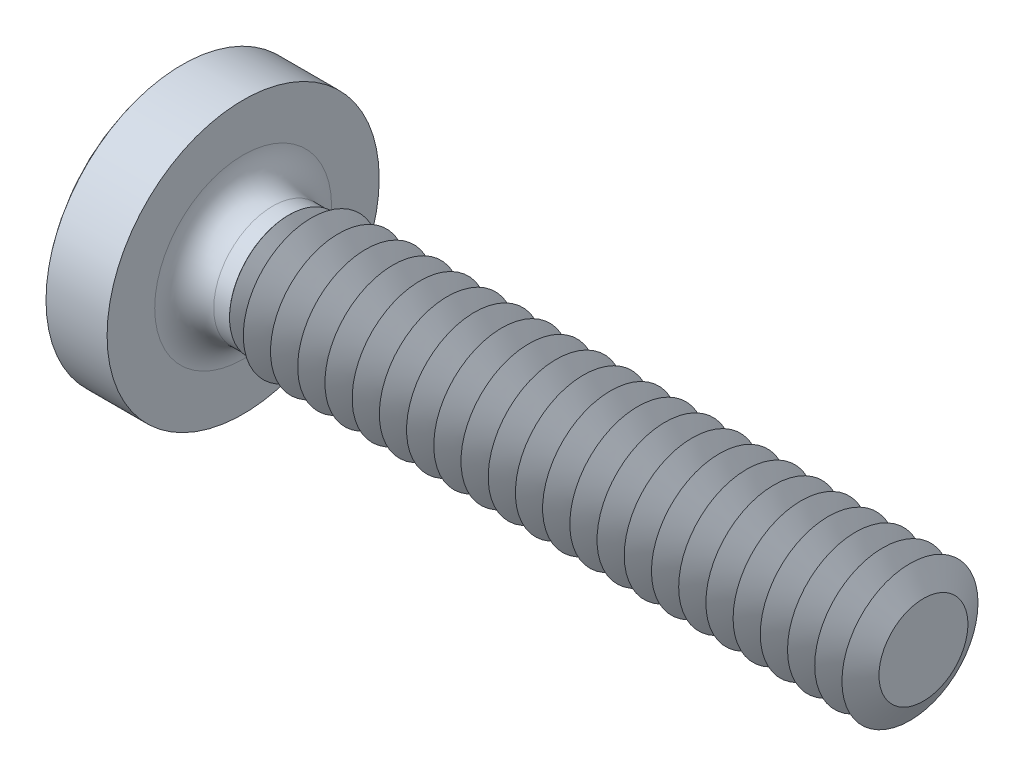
ISO-10303-21;
HEADER;
FILE_DESCRIPTION(('STEP AP214'),'2;1');
FILE_NAME('part.step','',(''),(''),'','','');
FILE_SCHEMA(('AUTOMOTIVE_DESIGN { 1 0 10303 214 1 1 1 1 }'));
ENDSEC;
DATA;
#1=APPLICATION_CONTEXT('core data for automotive mechanical design processes');
#2=APPLICATION_PROTOCOL_DEFINITION('international standard','automotive_design',2000,#1);
#3=PRODUCT_CONTEXT('',#1,'mechanical');
#4=PRODUCT('Part','Part','',(#3));
#5=PRODUCT_RELATED_PRODUCT_CATEGORY('part','',(#4));
#6=PRODUCT_DEFINITION_FORMATION('','',#4);
#7=PRODUCT_DEFINITION_CONTEXT('part definition',#1,'design');
#8=PRODUCT_DEFINITION('design','',#6,#7);
#9=PRODUCT_DEFINITION_SHAPE('','',#8);
#10=(LENGTH_UNIT() NAMED_UNIT(*) SI_UNIT(.MILLI.,.METRE.));
#11=(NAMED_UNIT(*) PLANE_ANGLE_UNIT() SI_UNIT($,.RADIAN.));
#12=(NAMED_UNIT(*) SI_UNIT($,.STERADIAN.) SOLID_ANGLE_UNIT());
#13=UNCERTAINTY_MEASURE_WITH_UNIT(LENGTH_MEASURE(1.E-05),#10,'distance_accuracy_value','');
#14=(GEOMETRIC_REPRESENTATION_CONTEXT(3) GLOBAL_UNCERTAINTY_ASSIGNED_CONTEXT((#13)) GLOBAL_UNIT_ASSIGNED_CONTEXT((#10,
#11,#12)) REPRESENTATION_CONTEXT('',''));
#15=CARTESIAN_POINT('',(0.,0.,0.));
#16=DIRECTION('',(0.,0.,1.));
#17=DIRECTION('',(1.,0.,0.));
#18=AXIS2_PLACEMENT_3D('',#15,#16,#17);
#19=CARTESIAN_POINT('',(11.6,0.,0.));
#20=DIRECTION('',(-1.,0.,0.));
#21=DIRECTION('',(0.,0.,1.));
#22=AXIS2_PLACEMENT_3D('',#19,#20,#21);
#23=PLANE('',#22);
#24=CARTESIAN_POINT('',(11.5999999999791,0.,0.));
#25=DIRECTION('',(-1.,0.,0.));
#26=DIRECTION('',(0.,0.,1.));
#27=AXIS2_PLACEMENT_3D('',#24,#25,#26);
#28=CIRCLE('',#27,0.653600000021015);
#29=CARTESIAN_POINT('',(11.5999999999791,0.,0.653600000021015));
#30=VERTEX_POINT('',#29);
#31=EDGE_CURVE('E592',#30,#30,#28,.T.);
#32=ORIENTED_EDGE('',*,*,#31,.F.);
#33=EDGE_LOOP('',(#32));
#34=FACE_BOUND('',#33,.T.);
#35=ADVANCED_FACE('F16',(#34),#23,.F.);
#36=CARTESIAN_POINT('',(11.4021664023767,0.,0.));
#37=DIRECTION('',(-1.,0.,0.));
#38=DIRECTION('',(0.,0.,1.));
#39=AXIS2_PLACEMENT_3D('',#36,#37,#38);
#40=CONICAL_SURFACE('',#39,0.999999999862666,1.05188801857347);
#41=CARTESIAN_POINT('',(11.4021664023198,0.,0.));
#42=DIRECTION('',(1.,0.,0.));
#43=DIRECTION('',(0.,0.,-1.));
#44=AXIS2_PLACEMENT_3D('',#41,#42,#43);
#45=CIRCLE('',#44,1.0000000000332);
#46=CARTESIAN_POINT('',(11.4021664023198,0.,-1.0000000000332));
#47=VERTEX_POINT('',#46);
#48=EDGE_CURVE('E588',#47,#47,#45,.F.);
#49=ORIENTED_EDGE('',*,*,#48,.F.);
#50=EDGE_LOOP('',(#49));
#51=FACE_BOUND('',#50,.T.);
#52=ORIENTED_EDGE('',*,*,#31,.T.);
#53=EDGE_LOOP('',(#52));
#54=FACE_BOUND('',#53,.T.);
#55=ADVANCED_FACE('F278',(#51,#54),#40,.T.);
#56=CARTESIAN_POINT('',(11.4021664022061,0.,0.));
#57=DIRECTION('',(1.,0.,0.));
#58=DIRECTION('',(0.,0.,-1.));
#59=AXIS2_PLACEMENT_3D('',#56,#57,#58);
#60=CONICAL_SURFACE('',#59,0.999999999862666,1.04250708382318);
#61=ORIENTED_EDGE('',*,*,#48,.T.);
#62=EDGE_LOOP('',(#61));
#63=FACE_BOUND('',#62,.T.);
#64=CARTESIAN_POINT('',(11.1999999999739,0.,0.));
#65=DIRECTION('',(-1.,0.,0.));
#66=DIRECTION('',(0.,0.,1.));
#67=AXIS2_PLACEMENT_3D('',#64,#65,#66);
#68=CIRCLE('',#67,0.653600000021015);
#69=CARTESIAN_POINT('',(11.1999999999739,0.,0.653600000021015));
#70=VERTEX_POINT('',#69);
#71=EDGE_CURVE('E591',#70,#70,#68,.T.);
#72=ORIENTED_EDGE('',*,*,#71,.F.);
#73=EDGE_LOOP('',(#72));
#74=FACE_BOUND('',#73,.T.);
#75=ADVANCED_FACE('F275',(#63,#74),#60,.T.);
#76=CARTESIAN_POINT('',(11.0021664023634,0.,0.));
#77=DIRECTION('',(-1.,0.,0.));
#78=DIRECTION('',(0.,0.,1.));
#79=AXIS2_PLACEMENT_3D('',#76,#77,#78);
#80=CONICAL_SURFACE('',#79,0.999999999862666,1.05188801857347);
#81=CARTESIAN_POINT('',(11.0021664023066,0.,0.));
#82=DIRECTION('',(1.,0.,0.));
#83=DIRECTION('',(0.,0.,-1.));
#84=AXIS2_PLACEMENT_3D('',#81,#82,#83);
#85=CIRCLE('',#84,0.999999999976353);
#86=CARTESIAN_POINT('',(11.0021664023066,0.,-0.999999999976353));
#87=VERTEX_POINT('',#86);
#88=EDGE_CURVE('E595',#87,#87,#85,.F.);
#89=ORIENTED_EDGE('',*,*,#88,.F.);
#90=EDGE_LOOP('',(#89));
#91=FACE_BOUND('',#90,.T.);
#92=ORIENTED_EDGE('',*,*,#71,.T.);
#93=EDGE_LOOP('',(#92));
#94=FACE_BOUND('',#93,.T.);
#95=ADVANCED_FACE('F271',(#91,#94),#80,.T.);
#96=CARTESIAN_POINT('',(11.0021664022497,0.,0.));
#97=DIRECTION('',(1.,0.,0.));
#98=DIRECTION('',(0.,0.,-1.));
#99=AXIS2_PLACEMENT_3D('',#96,#97,#98);
#100=CONICAL_SURFACE('',#99,0.999999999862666,1.04250708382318);
#101=ORIENTED_EDGE('',*,*,#88,.T.);
#102=EDGE_LOOP('',(#101));
#103=FACE_BOUND('',#102,.T.);
#104=CARTESIAN_POINT('',(10.7999999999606,0.,0.));
#105=DIRECTION('',(-1.,0.,0.));
#106=DIRECTION('',(0.,0.,1.));
#107=AXIS2_PLACEMENT_3D('',#104,#105,#106);
#108=CIRCLE('',#107,0.653600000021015);
#109=CARTESIAN_POINT('',(10.7999999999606,0.,0.653600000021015));
#110=VERTEX_POINT('',#109);
#111=EDGE_CURVE('E598',#110,#110,#108,.T.);
#112=ORIENTED_EDGE('',*,*,#111,.F.);
#113=EDGE_LOOP('',(#112));
#114=FACE_BOUND('',#113,.T.);
#115=ADVANCED_FACE('F267',(#103,#114),#100,.T.);
#116=CARTESIAN_POINT('',(10.6021664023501,0.,0.));
#117=DIRECTION('',(-1.,0.,0.));
#118=DIRECTION('',(0.,0.,1.));
#119=AXIS2_PLACEMENT_3D('',#116,#117,#118);
#120=CONICAL_SURFACE('',#119,0.999999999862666,1.05188801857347);
#121=CARTESIAN_POINT('',(10.6021664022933,0.,0.));
#122=DIRECTION('',(1.,0.,0.));
#123=DIRECTION('',(0.,0.,-1.));
#124=AXIS2_PLACEMENT_3D('',#121,#122,#123);
#125=CIRCLE('',#124,0.999999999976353);
#126=CARTESIAN_POINT('',(10.6021664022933,0.,-0.999999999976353));
#127=VERTEX_POINT('',#126);
#128=EDGE_CURVE('E601',#127,#127,#125,.F.);
#129=ORIENTED_EDGE('',*,*,#128,.F.);
#130=EDGE_LOOP('',(#129));
#131=FACE_BOUND('',#130,.T.);
#132=ORIENTED_EDGE('',*,*,#111,.T.);
#133=EDGE_LOOP('',(#132));
#134=FACE_BOUND('',#133,.T.);
#135=ADVANCED_FACE('F263',(#131,#134),#120,.T.);
#136=CARTESIAN_POINT('',(10.6021664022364,0.,0.));
#137=DIRECTION('',(1.,0.,0.));
#138=DIRECTION('',(0.,0.,-1.));
#139=AXIS2_PLACEMENT_3D('',#136,#137,#138);
#140=CONICAL_SURFACE('',#139,0.999999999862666,1.04250708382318);
#141=ORIENTED_EDGE('',*,*,#128,.T.);
#142=EDGE_LOOP('',(#141));
#143=FACE_BOUND('',#142,.T.);
#144=CARTESIAN_POINT('',(10.3999999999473,0.,0.));
#145=DIRECTION('',(-1.,0.,0.));
#146=DIRECTION('',(0.,0.,1.));
#147=AXIS2_PLACEMENT_3D('',#144,#145,#146);
#148=CIRCLE('',#147,0.653600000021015);
#149=CARTESIAN_POINT('',(10.3999999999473,0.,0.653600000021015));
#150=VERTEX_POINT('',#149);
#151=EDGE_CURVE('E604',#150,#150,#148,.T.);
#152=ORIENTED_EDGE('',*,*,#151,.F.);
#153=EDGE_LOOP('',(#152));
#154=FACE_BOUND('',#153,.T.);
#155=ADVANCED_FACE('F259',(#143,#154),#140,.T.);
#156=CARTESIAN_POINT('',(10.2021664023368,0.,0.));
#157=DIRECTION('',(-1.,0.,0.));
#158=DIRECTION('',(0.,0.,1.));
#159=AXIS2_PLACEMENT_3D('',#156,#157,#158);
#160=CONICAL_SURFACE('',#159,0.999999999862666,1.05188801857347);
#161=CARTESIAN_POINT('',(10.20216640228,0.,0.));
#162=DIRECTION('',(1.,0.,0.));
#163=DIRECTION('',(0.,0.,-1.));
#164=AXIS2_PLACEMENT_3D('',#161,#162,#163);
#165=CIRCLE('',#164,0.999999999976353);
#166=CARTESIAN_POINT('',(10.20216640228,0.,-0.999999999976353));
#167=VERTEX_POINT('',#166);
#168=EDGE_CURVE('E607',#167,#167,#165,.F.);
#169=ORIENTED_EDGE('',*,*,#168,.F.);
#170=EDGE_LOOP('',(#169));
#171=FACE_BOUND('',#170,.T.);
#172=ORIENTED_EDGE('',*,*,#151,.T.);
#173=EDGE_LOOP('',(#172));
#174=FACE_BOUND('',#173,.T.);
#175=ADVANCED_FACE('F255',(#171,#174),#160,.T.);
#176=CARTESIAN_POINT('',(10.2021664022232,0.,0.));
#177=DIRECTION('',(1.,0.,0.));
#178=DIRECTION('',(0.,0.,-1.));
#179=AXIS2_PLACEMENT_3D('',#176,#177,#178);
#180=CONICAL_SURFACE('',#179,0.999999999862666,1.04250708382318);
#181=ORIENTED_EDGE('',*,*,#168,.T.);
#182=EDGE_LOOP('',(#181));
#183=FACE_BOUND('',#182,.T.);
#184=CARTESIAN_POINT('',(9.99999999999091,0.,0.));
#185=DIRECTION('',(-1.,0.,0.));
#186=DIRECTION('',(0.,0.,1.));
#187=AXIS2_PLACEMENT_3D('',#184,#185,#186);
#188=CIRCLE('',#187,0.653600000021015);
#189=CARTESIAN_POINT('',(9.99999999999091,0.,0.653600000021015));
#190=VERTEX_POINT('',#189);
#191=EDGE_CURVE('E610',#190,#190,#188,.T.);
#192=ORIENTED_EDGE('',*,*,#191,.F.);
#193=EDGE_LOOP('',(#192));
#194=FACE_BOUND('',#193,.T.);
#195=ADVANCED_FACE('F251',(#183,#194),#180,.T.);
#196=CARTESIAN_POINT('',(9.80216640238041,0.,0.));
#197=DIRECTION('',(-1.,0.,0.));
#198=DIRECTION('',(0.,0.,1.));
#199=AXIS2_PLACEMENT_3D('',#196,#197,#198);
#200=CONICAL_SURFACE('',#199,0.999999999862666,1.05188801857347);
#201=CARTESIAN_POINT('',(9.80216640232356,0.,0.));
#202=DIRECTION('',(1.,0.,0.));
#203=DIRECTION('',(0.,0.,-1.));
#204=AXIS2_PLACEMENT_3D('',#201,#202,#203);
#205=CIRCLE('',#204,1.0000000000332);
#206=CARTESIAN_POINT('',(9.80216640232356,0.,-1.0000000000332));
#207=VERTEX_POINT('',#206);
#208=EDGE_CURVE('E613',#207,#207,#205,.F.);
#209=ORIENTED_EDGE('',*,*,#208,.F.);
#210=EDGE_LOOP('',(#209));
#211=FACE_BOUND('',#210,.T.);
#212=ORIENTED_EDGE('',*,*,#191,.T.);
#213=EDGE_LOOP('',(#212));
#214=FACE_BOUND('',#213,.T.);
#215=ADVANCED_FACE('F247',(#211,#214),#200,.T.);
#216=CARTESIAN_POINT('',(9.80216640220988,0.,0.));
#217=DIRECTION('',(1.,0.,0.));
#218=DIRECTION('',(0.,0.,-1.));
#219=AXIS2_PLACEMENT_3D('',#216,#217,#218);
#220=CONICAL_SURFACE('',#219,0.999999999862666,1.04250708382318);
#221=ORIENTED_EDGE('',*,*,#208,.T.);
#222=EDGE_LOOP('',(#221));
#223=FACE_BOUND('',#222,.T.);
#224=CARTESIAN_POINT('',(9.59999999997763,0.,0.));
#225=DIRECTION('',(-1.,0.,0.));
#226=DIRECTION('',(0.,0.,1.));
#227=AXIS2_PLACEMENT_3D('',#224,#225,#226);
#228=CIRCLE('',#227,0.653600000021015);
#229=CARTESIAN_POINT('',(9.59999999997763,0.,0.653600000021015));
#230=VERTEX_POINT('',#229);
#231=EDGE_CURVE('E616',#230,#230,#228,.T.);
#232=ORIENTED_EDGE('',*,*,#231,.F.);
#233=EDGE_LOOP('',(#232));
#234=FACE_BOUND('',#233,.T.);
#235=ADVANCED_FACE('F243',(#223,#234),#220,.T.);
#236=CARTESIAN_POINT('',(9.40216640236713,0.,0.));
#237=DIRECTION('',(-1.,0.,0.));
#238=DIRECTION('',(0.,0.,1.));
#239=AXIS2_PLACEMENT_3D('',#236,#237,#238);
#240=CONICAL_SURFACE('',#239,0.999999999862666,1.05188801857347);
#241=CARTESIAN_POINT('',(9.40216640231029,0.,0.));
#242=DIRECTION('',(1.,0.,0.));
#243=DIRECTION('',(0.,0.,-1.));
#244=AXIS2_PLACEMENT_3D('',#241,#242,#243);
#245=CIRCLE('',#244,0.999999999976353);
#246=CARTESIAN_POINT('',(9.40216640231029,0.,-0.999999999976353));
#247=VERTEX_POINT('',#246);
#248=EDGE_CURVE('E619',#247,#247,#245,.F.);
#249=ORIENTED_EDGE('',*,*,#248,.F.);
#250=EDGE_LOOP('',(#249));
#251=FACE_BOUND('',#250,.T.);
#252=ORIENTED_EDGE('',*,*,#231,.T.);
#253=EDGE_LOOP('',(#252));
#254=FACE_BOUND('',#253,.T.);
#255=ADVANCED_FACE('F239',(#251,#254),#240,.T.);
#256=CARTESIAN_POINT('',(9.40216640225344,0.,0.));
#257=DIRECTION('',(1.,0.,0.));
#258=DIRECTION('',(0.,0.,-1.));
#259=AXIS2_PLACEMENT_3D('',#256,#257,#258);
#260=CONICAL_SURFACE('',#259,0.999999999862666,1.04250708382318);
#261=ORIENTED_EDGE('',*,*,#248,.T.);
#262=EDGE_LOOP('',(#261));
#263=FACE_BOUND('',#262,.T.);
#264=CARTESIAN_POINT('',(9.19999999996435,0.,0.));
#265=DIRECTION('',(-1.,0.,0.));
#266=DIRECTION('',(0.,0.,1.));
#267=AXIS2_PLACEMENT_3D('',#264,#265,#266);
#268=CIRCLE('',#267,0.653600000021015);
#269=CARTESIAN_POINT('',(9.19999999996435,0.,0.653600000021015));
#270=VERTEX_POINT('',#269);
#271=EDGE_CURVE('E622',#270,#270,#268,.T.);
#272=ORIENTED_EDGE('',*,*,#271,.F.);
#273=EDGE_LOOP('',(#272));
#274=FACE_BOUND('',#273,.T.);
#275=ADVANCED_FACE('F235',(#263,#274),#260,.T.);
#276=CARTESIAN_POINT('',(9.00216640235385,0.,0.));
#277=DIRECTION('',(-1.,0.,0.));
#278=DIRECTION('',(0.,0.,1.));
#279=AXIS2_PLACEMENT_3D('',#276,#277,#278);
#280=CONICAL_SURFACE('',#279,0.999999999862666,1.05188801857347);
#281=CARTESIAN_POINT('',(9.00216640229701,0.,0.));
#282=DIRECTION('',(1.,0.,0.));
#283=DIRECTION('',(0.,0.,-1.));
#284=AXIS2_PLACEMENT_3D('',#281,#282,#283);
#285=CIRCLE('',#284,0.999999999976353);
#286=CARTESIAN_POINT('',(9.00216640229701,0.,-0.999999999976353));
#287=VERTEX_POINT('',#286);
#288=EDGE_CURVE('E625',#287,#287,#285,.F.);
#289=ORIENTED_EDGE('',*,*,#288,.F.);
#290=EDGE_LOOP('',(#289));
#291=FACE_BOUND('',#290,.T.);
#292=ORIENTED_EDGE('',*,*,#271,.T.);
#293=EDGE_LOOP('',(#292));
#294=FACE_BOUND('',#293,.T.);
#295=ADVANCED_FACE('F231',(#291,#294),#280,.T.);
#296=CARTESIAN_POINT('',(9.00216640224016,0.,0.));
#297=DIRECTION('',(1.,0.,0.));
#298=DIRECTION('',(0.,0.,-1.));
#299=AXIS2_PLACEMENT_3D('',#296,#297,#298);
#300=CONICAL_SURFACE('',#299,0.999999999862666,1.04250708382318);
#301=ORIENTED_EDGE('',*,*,#288,.T.);
#302=EDGE_LOOP('',(#301));
#303=FACE_BOUND('',#302,.T.);
#304=CARTESIAN_POINT('',(8.79999999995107,0.,0.));
#305=DIRECTION('',(-1.,0.,0.));
#306=DIRECTION('',(0.,0.,1.));
#307=AXIS2_PLACEMENT_3D('',#304,#305,#306);
#308=CIRCLE('',#307,0.653600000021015);
#309=CARTESIAN_POINT('',(8.79999999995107,0.,0.653600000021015));
#310=VERTEX_POINT('',#309);
#311=EDGE_CURVE('E628',#310,#310,#308,.T.);
#312=ORIENTED_EDGE('',*,*,#311,.F.);
#313=EDGE_LOOP('',(#312));
#314=FACE_BOUND('',#313,.T.);
#315=ADVANCED_FACE('F227',(#303,#314),#300,.T.);
#316=CARTESIAN_POINT('',(8.60216640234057,0.,0.));
#317=DIRECTION('',(-1.,0.,0.));
#318=DIRECTION('',(0.,0.,1.));
#319=AXIS2_PLACEMENT_3D('',#316,#317,#318);
#320=CONICAL_SURFACE('',#319,0.999999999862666,1.05188801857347);
#321=CARTESIAN_POINT('',(8.60216640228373,0.,0.));
#322=DIRECTION('',(1.,0.,0.));
#323=DIRECTION('',(0.,0.,-1.));
#324=AXIS2_PLACEMENT_3D('',#321,#322,#323);
#325=CIRCLE('',#324,0.999999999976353);
#326=CARTESIAN_POINT('',(8.60216640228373,0.,-0.999999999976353));
#327=VERTEX_POINT('',#326);
#328=EDGE_CURVE('E631',#327,#327,#325,.F.);
#329=ORIENTED_EDGE('',*,*,#328,.F.);
#330=EDGE_LOOP('',(#329));
#331=FACE_BOUND('',#330,.T.);
#332=ORIENTED_EDGE('',*,*,#311,.T.);
#333=EDGE_LOOP('',(#332));
#334=FACE_BOUND('',#333,.T.);
#335=ADVANCED_FACE('F223',(#331,#334),#320,.T.);
#336=CARTESIAN_POINT('',(8.60216640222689,0.,0.));
#337=DIRECTION('',(1.,0.,0.));
#338=DIRECTION('',(0.,0.,-1.));
#339=AXIS2_PLACEMENT_3D('',#336,#337,#338);
#340=CONICAL_SURFACE('',#339,0.999999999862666,1.04250708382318);
#341=ORIENTED_EDGE('',*,*,#328,.T.);
#342=EDGE_LOOP('',(#341));
#343=FACE_BOUND('',#342,.T.);
#344=CARTESIAN_POINT('',(8.39999999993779,0.,0.));
#345=DIRECTION('',(-1.,0.,0.));
#346=DIRECTION('',(0.,0.,1.));
#347=AXIS2_PLACEMENT_3D('',#344,#345,#346);
#348=CIRCLE('',#347,0.653600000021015);
#349=CARTESIAN_POINT('',(8.39999999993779,0.,0.653600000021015));
#350=VERTEX_POINT('',#349);
#351=EDGE_CURVE('E634',#350,#350,#348,.T.);
#352=ORIENTED_EDGE('',*,*,#351,.F.);
#353=EDGE_LOOP('',(#352));
#354=FACE_BOUND('',#353,.T.);
#355=ADVANCED_FACE('F219',(#343,#354),#340,.T.);
#356=CARTESIAN_POINT('',(8.20216640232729,0.,0.));
#357=DIRECTION('',(-1.,0.,0.));
#358=DIRECTION('',(0.,0.,1.));
#359=AXIS2_PLACEMENT_3D('',#356,#357,#358);
#360=CONICAL_SURFACE('',#359,0.999999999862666,1.05188801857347);
#361=CARTESIAN_POINT('',(8.20216640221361,0.,0.));
#362=DIRECTION('',(1.,0.,0.));
#363=DIRECTION('',(0.,0.,-1.));
#364=AXIS2_PLACEMENT_3D('',#361,#362,#363);
#365=CIRCLE('',#364,0.999999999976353);
#366=CARTESIAN_POINT('',(8.20216640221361,0.,-0.999999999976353));
#367=VERTEX_POINT('',#366);
#368=EDGE_CURVE('E637',#367,#367,#365,.F.);
#369=ORIENTED_EDGE('',*,*,#368,.F.);
#370=EDGE_LOOP('',(#369));
#371=FACE_BOUND('',#370,.T.);
#372=ORIENTED_EDGE('',*,*,#351,.T.);
#373=EDGE_LOOP('',(#372));
#374=FACE_BOUND('',#373,.T.);
#375=ADVANCED_FACE('F215',(#371,#374),#360,.T.);
#376=CARTESIAN_POINT('',(8.20216640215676,0.,0.));
#377=DIRECTION('',(1.,0.,0.));
#378=DIRECTION('',(0.,0.,-1.));
#379=AXIS2_PLACEMENT_3D('',#376,#377,#378);
#380=CONICAL_SURFACE('',#379,0.999999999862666,1.04250708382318);
#381=ORIENTED_EDGE('',*,*,#368,.T.);
#382=EDGE_LOOP('',(#381));
#383=FACE_BOUND('',#382,.T.);
#384=CARTESIAN_POINT('',(7.99999999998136,0.,0.));
#385=DIRECTION('',(-1.,0.,0.));
#386=DIRECTION('',(0.,0.,1.));
#387=AXIS2_PLACEMENT_3D('',#384,#385,#386);
#388=CIRCLE('',#387,0.653600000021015);
#389=CARTESIAN_POINT('',(7.99999999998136,0.,0.653600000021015));
#390=VERTEX_POINT('',#389);
#391=EDGE_CURVE('E640',#390,#390,#388,.T.);
#392=ORIENTED_EDGE('',*,*,#391,.F.);
#393=EDGE_LOOP('',(#392));
#394=FACE_BOUND('',#393,.T.);
#395=ADVANCED_FACE('F211',(#383,#394),#380,.T.);
#396=CARTESIAN_POINT('',(7.80216640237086,0.,0.));
#397=DIRECTION('',(-1.,0.,0.));
#398=DIRECTION('',(0.,-1.,0.));
#399=AXIS2_PLACEMENT_3D('',#396,#397,#398);
#400=CONICAL_SURFACE('',#399,0.999999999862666,1.05188801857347);
#401=CARTESIAN_POINT('',(7.80216640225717,0.,0.));
#402=DIRECTION('',(1.,0.,0.));
#403=DIRECTION('',(0.,0.,-1.));
#404=AXIS2_PLACEMENT_3D('',#401,#402,#403);
#405=CIRCLE('',#404,0.999999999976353);
#406=CARTESIAN_POINT('',(7.80216640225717,0.,-0.999999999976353));
#407=VERTEX_POINT('',#406);
#408=EDGE_CURVE('E643',#407,#407,#405,.F.);
#409=ORIENTED_EDGE('',*,*,#408,.F.);
#410=EDGE_LOOP('',(#409));
#411=FACE_BOUND('',#410,.T.);
#412=ORIENTED_EDGE('',*,*,#391,.T.);
#413=EDGE_LOOP('',(#412));
#414=FACE_BOUND('',#413,.T.);
#415=ADVANCED_FACE('F207',(#411,#414),#400,.T.);
#416=CARTESIAN_POINT('',(7.80216640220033,0.,0.));
#417=DIRECTION('',(1.,0.,0.));
#418=DIRECTION('',(0.,1.,0.));
#419=AXIS2_PLACEMENT_3D('',#416,#417,#418);
#420=CONICAL_SURFACE('',#419,0.999999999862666,1.04250708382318);
#421=ORIENTED_EDGE('',*,*,#408,.T.);
#422=EDGE_LOOP('',(#421));
#423=FACE_BOUND('',#422,.T.);
#424=CARTESIAN_POINT('',(7.59999999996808,0.,0.));
#425=DIRECTION('',(-1.,0.,0.));
#426=DIRECTION('',(0.,0.,1.));
#427=AXIS2_PLACEMENT_3D('',#424,#425,#426);
#428=CIRCLE('',#427,0.653600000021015);
#429=CARTESIAN_POINT('',(7.59999999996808,0.,0.653600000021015));
#430=VERTEX_POINT('',#429);
#431=EDGE_CURVE('E646',#430,#430,#428,.T.);
#432=ORIENTED_EDGE('',*,*,#431,.F.);
#433=EDGE_LOOP('',(#432));
#434=FACE_BOUND('',#433,.T.);
#435=ADVANCED_FACE('F203',(#423,#434),#420,.T.);
#436=CARTESIAN_POINT('',(7.40216640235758,0.,0.));
#437=DIRECTION('',(-1.,0.,0.));
#438=DIRECTION('',(0.,-1.,0.));
#439=AXIS2_PLACEMENT_3D('',#436,#437,#438);
#440=CONICAL_SURFACE('',#439,0.999999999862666,1.05188801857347);
#441=CARTESIAN_POINT('',(7.40216640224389,0.,0.));
#442=DIRECTION('',(1.,0.,0.));
#443=DIRECTION('',(0.,0.,-1.));
#444=AXIS2_PLACEMENT_3D('',#441,#442,#443);
#445=CIRCLE('',#444,0.999999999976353);
#446=CARTESIAN_POINT('',(7.40216640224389,0.,-0.999999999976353));
#447=VERTEX_POINT('',#446);
#448=EDGE_CURVE('E649',#447,#447,#445,.F.);
#449=ORIENTED_EDGE('',*,*,#448,.F.);
#450=EDGE_LOOP('',(#449));
#451=FACE_BOUND('',#450,.T.);
#452=ORIENTED_EDGE('',*,*,#431,.T.);
#453=EDGE_LOOP('',(#452));
#454=FACE_BOUND('',#453,.T.);
#455=ADVANCED_FACE('F199',(#451,#454),#440,.T.);
#456=CARTESIAN_POINT('',(7.40216640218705,0.,0.));
#457=DIRECTION('',(1.,0.,0.));
#458=DIRECTION('',(0.,1.,0.));
#459=AXIS2_PLACEMENT_3D('',#456,#457,#458);
#460=CONICAL_SURFACE('',#459,0.999999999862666,1.04250708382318);
#461=ORIENTED_EDGE('',*,*,#448,.T.);
#462=EDGE_LOOP('',(#461));
#463=FACE_BOUND('',#462,.T.);
#464=CARTESIAN_POINT('',(7.1999999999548,0.,0.));
#465=DIRECTION('',(-1.,0.,0.));
#466=DIRECTION('',(0.,0.,1.));
#467=AXIS2_PLACEMENT_3D('',#464,#465,#466);
#468=CIRCLE('',#467,0.653600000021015);
#469=CARTESIAN_POINT('',(7.1999999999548,0.,0.653600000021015));
#470=VERTEX_POINT('',#469);
#471=EDGE_CURVE('E652',#470,#470,#468,.T.);
#472=ORIENTED_EDGE('',*,*,#471,.F.);
#473=EDGE_LOOP('',(#472));
#474=FACE_BOUND('',#473,.T.);
#475=ADVANCED_FACE('F195',(#463,#474),#460,.T.);
#476=CARTESIAN_POINT('',(7.00216640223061,0.,0.));
#477=DIRECTION('',(-1.,0.,0.));
#478=DIRECTION('',(0.,0.,1.));
#479=AXIS2_PLACEMENT_3D('',#476,#477,#478);
#480=CONICAL_SURFACE('',#479,1.00000000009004,1.05188801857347);
#481=CARTESIAN_POINT('',(7.00216640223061,0.,0.));
#482=DIRECTION('',(1.,0.,0.));
#483=DIRECTION('',(0.,0.,-1.));
#484=AXIS2_PLACEMENT_3D('',#481,#482,#483);
#485=CIRCLE('',#484,0.999999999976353);
#486=CARTESIAN_POINT('',(7.00216640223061,0.,-0.999999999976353));
#487=VERTEX_POINT('',#486);
#488=EDGE_CURVE('E655',#487,#487,#485,.F.);
#489=ORIENTED_EDGE('',*,*,#488,.F.);
#490=EDGE_LOOP('',(#489));
#491=FACE_BOUND('',#490,.T.);
#492=ORIENTED_EDGE('',*,*,#471,.T.);
#493=EDGE_LOOP('',(#492));
#494=FACE_BOUND('',#493,.T.);
#495=ADVANCED_FACE('F191',(#491,#494),#480,.T.);
#496=CARTESIAN_POINT('',(7.00216640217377,0.,0.));
#497=DIRECTION('',(1.,0.,0.));
#498=DIRECTION('',(0.,1.,0.));
#499=AXIS2_PLACEMENT_3D('',#496,#497,#498);
#500=CONICAL_SURFACE('',#499,0.999999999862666,1.04250708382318);
#501=ORIENTED_EDGE('',*,*,#488,.T.);
#502=EDGE_LOOP('',(#501));
#503=FACE_BOUND('',#502,.T.);
#504=CARTESIAN_POINT('',(6.79999999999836,0.,0.));
#505=DIRECTION('',(-1.,0.,0.));
#506=DIRECTION('',(0.,0.,1.));
#507=AXIS2_PLACEMENT_3D('',#504,#505,#506);
#508=CIRCLE('',#507,0.653599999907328);
#509=CARTESIAN_POINT('',(6.79999999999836,0.,0.653599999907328));
#510=VERTEX_POINT('',#509);
#511=EDGE_CURVE('E658',#510,#510,#508,.T.);
#512=ORIENTED_EDGE('',*,*,#511,.F.);
#513=EDGE_LOOP('',(#512));
#514=FACE_BOUND('',#513,.T.);
#515=ADVANCED_FACE('F187',(#503,#514),#500,.T.);
#516=CARTESIAN_POINT('',(6.60216640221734,0.,0.));
#517=DIRECTION('',(-1.,0.,0.));
#518=DIRECTION('',(0.,0.,1.));
#519=AXIS2_PLACEMENT_3D('',#516,#517,#518);
#520=CONICAL_SURFACE('',#519,1.00000000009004,1.05188801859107);
#521=CARTESIAN_POINT('',(6.60216640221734,0.,0.));
#522=DIRECTION('',(1.,0.,0.));
#523=DIRECTION('',(0.,0.,-1.));
#524=AXIS2_PLACEMENT_3D('',#521,#522,#523);
#525=CIRCLE('',#524,0.999999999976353);
#526=CARTESIAN_POINT('',(6.60216640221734,0.,-0.999999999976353));
#527=VERTEX_POINT('',#526);
#528=EDGE_CURVE('E661',#527,#527,#525,.F.);
#529=ORIENTED_EDGE('',*,*,#528,.F.);
#530=EDGE_LOOP('',(#529));
#531=FACE_BOUND('',#530,.T.);
#532=ORIENTED_EDGE('',*,*,#511,.T.);
#533=EDGE_LOOP('',(#532));
#534=FACE_BOUND('',#533,.T.);
#535=ADVANCED_FACE('F183',(#531,#534),#520,.T.);
#536=CARTESIAN_POINT('',(6.60216640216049,0.,0.));
#537=DIRECTION('',(1.,0.,0.));
#538=DIRECTION('',(0.,1.,0.));
#539=AXIS2_PLACEMENT_3D('',#536,#537,#538);
#540=CONICAL_SURFACE('',#539,0.999999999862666,1.04250708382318);
#541=ORIENTED_EDGE('',*,*,#528,.T.);
#542=EDGE_LOOP('',(#541));
#543=FACE_BOUND('',#542,.T.);
#544=CARTESIAN_POINT('',(6.39999999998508,0.,0.));
#545=DIRECTION('',(-1.,0.,0.));
#546=DIRECTION('',(0.,0.,1.));
#547=AXIS2_PLACEMENT_3D('',#544,#545,#546);
#548=CIRCLE('',#547,0.653600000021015);
#549=CARTESIAN_POINT('',(6.39999999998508,0.,0.653600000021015));
#550=VERTEX_POINT('',#549);
#551=EDGE_CURVE('E664',#550,#550,#548,.T.);
#552=ORIENTED_EDGE('',*,*,#551,.F.);
#553=EDGE_LOOP('',(#552));
#554=FACE_BOUND('',#553,.T.);
#555=ADVANCED_FACE('F179',(#543,#554),#540,.T.);
#556=CARTESIAN_POINT('',(6.2021664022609,0.,0.));
#557=DIRECTION('',(-1.,0.,0.));
#558=DIRECTION('',(0.,0.,1.));
#559=AXIS2_PLACEMENT_3D('',#556,#557,#558);
#560=CONICAL_SURFACE('',#559,1.00000000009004,1.05188801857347);
#561=CARTESIAN_POINT('',(6.20216640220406,0.,0.));
#562=DIRECTION('',(1.,0.,0.));
#563=DIRECTION('',(0.,0.,-1.));
#564=AXIS2_PLACEMENT_3D('',#561,#562,#563);
#565=CIRCLE('',#564,0.999999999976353);
#566=CARTESIAN_POINT('',(6.20216640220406,0.,-0.999999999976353));
#567=VERTEX_POINT('',#566);
#568=EDGE_CURVE('E667',#567,#567,#565,.F.);
#569=ORIENTED_EDGE('',*,*,#568,.F.);
#570=EDGE_LOOP('',(#569));
#571=FACE_BOUND('',#570,.T.);
#572=ORIENTED_EDGE('',*,*,#551,.T.);
#573=EDGE_LOOP('',(#572));
#574=FACE_BOUND('',#573,.T.);
#575=ADVANCED_FACE('F175',(#571,#574),#560,.T.);
#576=CARTESIAN_POINT('',(6.20216640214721,0.,0.));
#577=DIRECTION('',(1.,0.,0.));
#578=DIRECTION('',(0.,1.,0.));
#579=AXIS2_PLACEMENT_3D('',#576,#577,#578);
#580=CONICAL_SURFACE('',#579,0.999999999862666,1.04250708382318);
#581=ORIENTED_EDGE('',*,*,#568,.T.);
#582=EDGE_LOOP('',(#581));
#583=FACE_BOUND('',#582,.T.);
#584=CARTESIAN_POINT('',(6.00000000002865,0.,0.));
#585=DIRECTION('',(-1.,0.,0.));
#586=DIRECTION('',(0.,0.,1.));
#587=AXIS2_PLACEMENT_3D('',#584,#585,#586);
#588=CIRCLE('',#587,0.653599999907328);
#589=CARTESIAN_POINT('',(6.00000000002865,0.,0.653599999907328));
#590=VERTEX_POINT('',#589);
#591=EDGE_CURVE('E670',#590,#590,#588,.T.);
#592=ORIENTED_EDGE('',*,*,#591,.F.);
#593=EDGE_LOOP('',(#592));
#594=FACE_BOUND('',#593,.T.);
#595=ADVANCED_FACE('F171',(#583,#594),#580,.T.);
#596=CARTESIAN_POINT('',(5.80216640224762,0.,0.));
#597=DIRECTION('',(-1.,0.,0.));
#598=DIRECTION('',(0.,0.,1.));
#599=AXIS2_PLACEMENT_3D('',#596,#597,#598);
#600=CONICAL_SURFACE('',#599,1.00000000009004,1.05188801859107);
#601=CARTESIAN_POINT('',(5.80216640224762,0.,0.));
#602=DIRECTION('',(1.,0.,0.));
#603=DIRECTION('',(0.,0.,-1.));
#604=AXIS2_PLACEMENT_3D('',#601,#602,#603);
#605=CIRCLE('',#604,0.999999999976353);
#606=CARTESIAN_POINT('',(5.80216640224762,0.,-0.999999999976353));
#607=VERTEX_POINT('',#606);
#608=EDGE_CURVE('E673',#607,#607,#605,.F.);
#609=ORIENTED_EDGE('',*,*,#608,.F.);
#610=EDGE_LOOP('',(#609));
#611=FACE_BOUND('',#610,.T.);
#612=ORIENTED_EDGE('',*,*,#591,.T.);
#613=EDGE_LOOP('',(#612));
#614=FACE_BOUND('',#613,.T.);
#615=ADVANCED_FACE('F167',(#611,#614),#600,.T.);
#616=CARTESIAN_POINT('',(5.80216640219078,0.,0.));
#617=DIRECTION('',(1.,0.,0.));
#618=DIRECTION('',(0.,0.,-1.));
#619=AXIS2_PLACEMENT_3D('',#616,#617,#618);
#620=CONICAL_SURFACE('',#619,0.999999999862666,1.04250708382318);
#621=ORIENTED_EDGE('',*,*,#608,.T.);
#622=EDGE_LOOP('',(#621));
#623=FACE_BOUND('',#622,.T.);
#624=CARTESIAN_POINT('',(5.59999999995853,0.,0.));
#625=DIRECTION('',(-1.,0.,0.));
#626=DIRECTION('',(0.,0.,1.));
#627=AXIS2_PLACEMENT_3D('',#624,#625,#626);
#628=CIRCLE('',#627,0.653600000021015);
#629=CARTESIAN_POINT('',(5.59999999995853,0.,0.653600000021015));
#630=VERTEX_POINT('',#629);
#631=EDGE_CURVE('E676',#630,#630,#628,.T.);
#632=ORIENTED_EDGE('',*,*,#631,.F.);
#633=EDGE_LOOP('',(#632));
#634=FACE_BOUND('',#633,.T.);
#635=ADVANCED_FACE('F163',(#623,#634),#620,.T.);
#636=CARTESIAN_POINT('',(5.40216640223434,0.,0.));
#637=DIRECTION('',(-1.,0.,0.));
#638=DIRECTION('',(0.,0.,1.));
#639=AXIS2_PLACEMENT_3D('',#636,#637,#638);
#640=CONICAL_SURFACE('',#639,1.00000000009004,1.05188801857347);
#641=CARTESIAN_POINT('',(5.40216640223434,0.,0.));
#642=DIRECTION('',(1.,0.,0.));
#643=DIRECTION('',(0.,0.,-1.));
#644=AXIS2_PLACEMENT_3D('',#641,#642,#643);
#645=CIRCLE('',#644,0.999999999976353);
#646=CARTESIAN_POINT('',(5.40216640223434,0.,-0.999999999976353));
#647=VERTEX_POINT('',#646);
#648=EDGE_CURVE('E679',#647,#647,#645,.F.);
#649=ORIENTED_EDGE('',*,*,#648,.F.);
#650=EDGE_LOOP('',(#649));
#651=FACE_BOUND('',#650,.T.);
#652=ORIENTED_EDGE('',*,*,#631,.T.);
#653=EDGE_LOOP('',(#652));
#654=FACE_BOUND('',#653,.T.);
#655=ADVANCED_FACE('F159',(#651,#654),#640,.T.);
#656=CARTESIAN_POINT('',(5.4021664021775,0.,0.));
#657=DIRECTION('',(1.,0.,0.));
#658=DIRECTION('',(0.,0.,-1.));
#659=AXIS2_PLACEMENT_3D('',#656,#657,#658);
#660=CONICAL_SURFACE('',#659,0.999999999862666,1.04250708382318);
#661=ORIENTED_EDGE('',*,*,#648,.T.);
#662=EDGE_LOOP('',(#661));
#663=FACE_BOUND('',#662,.T.);
#664=CARTESIAN_POINT('',(5.20000000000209,0.,0.));
#665=DIRECTION('',(-1.,0.,0.));
#666=DIRECTION('',(0.,0.,1.));
#667=AXIS2_PLACEMENT_3D('',#664,#665,#666);
#668=CIRCLE('',#667,0.653599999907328);
#669=CARTESIAN_POINT('',(5.20000000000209,0.,0.653599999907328));
#670=VERTEX_POINT('',#669);
#671=EDGE_CURVE('E682',#670,#670,#668,.T.);
#672=ORIENTED_EDGE('',*,*,#671,.F.);
#673=EDGE_LOOP('',(#672));
#674=FACE_BOUND('',#673,.T.);
#675=ADVANCED_FACE('F155',(#663,#674),#660,.T.);
#676=CARTESIAN_POINT('',(5.00216640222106,0.,0.));
#677=DIRECTION('',(-1.,0.,0.));
#678=DIRECTION('',(0.,0.,1.));
#679=AXIS2_PLACEMENT_3D('',#676,#677,#678);
#680=CONICAL_SURFACE('',#679,1.00000000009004,1.05188801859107);
#681=CARTESIAN_POINT('',(5.00216640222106,0.,0.));
#682=DIRECTION('',(1.,0.,0.));
#683=DIRECTION('',(0.,0.,-1.));
#684=AXIS2_PLACEMENT_3D('',#681,#682,#683);
#685=CIRCLE('',#684,0.999999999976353);
#686=CARTESIAN_POINT('',(5.00216640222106,0.,-0.999999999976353));
#687=VERTEX_POINT('',#686);
#688=EDGE_CURVE('E685',#687,#687,#685,.F.);
#689=ORIENTED_EDGE('',*,*,#688,.F.);
#690=EDGE_LOOP('',(#689));
#691=FACE_BOUND('',#690,.T.);
#692=ORIENTED_EDGE('',*,*,#671,.T.);
#693=EDGE_LOOP('',(#692));
#694=FACE_BOUND('',#693,.T.);
#695=ADVANCED_FACE('F151',(#691,#694),#680,.T.);
#696=CARTESIAN_POINT('',(5.00216640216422,0.,0.));
#697=DIRECTION('',(1.,0.,0.));
#698=DIRECTION('',(0.,0.,-1.));
#699=AXIS2_PLACEMENT_3D('',#696,#697,#698);
#700=CONICAL_SURFACE('',#699,0.999999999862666,1.04250708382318);
#701=ORIENTED_EDGE('',*,*,#688,.T.);
#702=EDGE_LOOP('',(#701));
#703=FACE_BOUND('',#702,.T.);
#704=CARTESIAN_POINT('',(4.79999999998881,0.,0.));
#705=DIRECTION('',(-1.,0.,0.));
#706=DIRECTION('',(0.,0.,1.));
#707=AXIS2_PLACEMENT_3D('',#704,#705,#706);
#708=CIRCLE('',#707,0.653600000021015);
#709=CARTESIAN_POINT('',(4.79999999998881,0.,0.653600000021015));
#710=VERTEX_POINT('',#709);
#711=EDGE_CURVE('E688',#710,#710,#708,.T.);
#712=ORIENTED_EDGE('',*,*,#711,.F.);
#713=EDGE_LOOP('',(#712));
#714=FACE_BOUND('',#713,.T.);
#715=ADVANCED_FACE('F147',(#703,#714),#700,.T.);
#716=CARTESIAN_POINT('',(4.60216640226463,0.,0.));
#717=DIRECTION('',(-1.,0.,0.));
#718=DIRECTION('',(0.,0.,1.));
#719=AXIS2_PLACEMENT_3D('',#716,#717,#718);
#720=CONICAL_SURFACE('',#719,1.00000000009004,1.05188801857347);
#721=CARTESIAN_POINT('',(4.60216640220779,0.,0.));
#722=DIRECTION('',(1.,0.,0.));
#723=DIRECTION('',(0.,0.,-1.));
#724=AXIS2_PLACEMENT_3D('',#721,#722,#723);
#725=CIRCLE('',#724,0.999999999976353);
#726=CARTESIAN_POINT('',(4.60216640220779,0.,-0.999999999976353));
#727=VERTEX_POINT('',#726);
#728=EDGE_CURVE('E691',#727,#727,#725,.F.);
#729=ORIENTED_EDGE('',*,*,#728,.F.);
#730=EDGE_LOOP('',(#729));
#731=FACE_BOUND('',#730,.T.);
#732=ORIENTED_EDGE('',*,*,#711,.T.);
#733=EDGE_LOOP('',(#732));
#734=FACE_BOUND('',#733,.T.);
#735=ADVANCED_FACE('F143',(#731,#734),#720,.T.);
#736=CARTESIAN_POINT('',(4.60216640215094,0.,0.));
#737=DIRECTION('',(1.,0.,0.));
#738=DIRECTION('',(0.,0.,-1.));
#739=AXIS2_PLACEMENT_3D('',#736,#737,#738);
#740=CONICAL_SURFACE('',#739,0.999999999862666,1.04250708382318);
#741=ORIENTED_EDGE('',*,*,#728,.T.);
#742=EDGE_LOOP('',(#741));
#743=FACE_BOUND('',#742,.T.);
#744=CARTESIAN_POINT('',(4.39999999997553,0.,0.));
#745=DIRECTION('',(-1.,0.,0.));
#746=DIRECTION('',(0.,0.,1.));
#747=AXIS2_PLACEMENT_3D('',#744,#745,#746);
#748=CIRCLE('',#747,0.653600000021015);
#749=CARTESIAN_POINT('',(4.39999999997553,0.,0.653600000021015));
#750=VERTEX_POINT('',#749);
#751=EDGE_CURVE('E694',#750,#750,#748,.T.);
#752=ORIENTED_EDGE('',*,*,#751,.F.);
#753=EDGE_LOOP('',(#752));
#754=FACE_BOUND('',#753,.T.);
#755=ADVANCED_FACE('F139',(#743,#754),#740,.T.);
#756=CARTESIAN_POINT('',(4.20216640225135,0.,0.));
#757=DIRECTION('',(-1.,0.,0.));
#758=DIRECTION('',(0.,0.,1.));
#759=AXIS2_PLACEMENT_3D('',#756,#757,#758);
#760=CONICAL_SURFACE('',#759,1.00000000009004,1.05188801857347);
#761=CARTESIAN_POINT('',(4.20216640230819,0.,0.));
#762=DIRECTION('',(1.,0.,0.));
#763=DIRECTION('',(0.,0.,-1.));
#764=AXIS2_PLACEMENT_3D('',#761,#762,#763);
#765=CIRCLE('',#764,1.0000000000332);
#766=CARTESIAN_POINT('',(4.20216640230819,0.,-1.0000000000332));
#767=VERTEX_POINT('',#766);
#768=EDGE_CURVE('E697',#767,#767,#765,.F.);
#769=ORIENTED_EDGE('',*,*,#768,.F.);
#770=EDGE_LOOP('',(#769));
#771=FACE_BOUND('',#770,.T.);
#772=ORIENTED_EDGE('',*,*,#751,.T.);
#773=EDGE_LOOP('',(#772));
#774=FACE_BOUND('',#773,.T.);
#775=ADVANCED_FACE('F135',(#771,#774),#760,.T.);
#776=CARTESIAN_POINT('',(4.20216640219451,0.,0.));
#777=DIRECTION('',(1.,0.,0.));
#778=DIRECTION('',(0.,0.,-1.));
#779=AXIS2_PLACEMENT_3D('',#776,#777,#778);
#780=CONICAL_SURFACE('',#779,0.999999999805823,1.04250708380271);
#781=ORIENTED_EDGE('',*,*,#768,.T.);
#782=EDGE_LOOP('',(#781));
#783=FACE_BOUND('',#782,.T.);
#784=CARTESIAN_POINT('',(3.99999999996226,0.,0.));
#785=DIRECTION('',(-1.,0.,0.));
#786=DIRECTION('',(0.,0.,1.));
#787=AXIS2_PLACEMENT_3D('',#784,#785,#786);
#788=CIRCLE('',#787,0.653600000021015);
#789=CARTESIAN_POINT('',(3.99999999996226,0.,0.653600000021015));
#790=VERTEX_POINT('',#789);
#791=EDGE_CURVE('E700',#790,#790,#788,.T.);
#792=ORIENTED_EDGE('',*,*,#791,.F.);
#793=EDGE_LOOP('',(#792));
#794=FACE_BOUND('',#793,.T.);
#795=ADVANCED_FACE('F131',(#783,#794),#780,.T.);
#796=CARTESIAN_POINT('',(3.80216640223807,0.,0.));
#797=DIRECTION('',(-1.,0.,0.));
#798=DIRECTION('',(0.,0.,1.));
#799=AXIS2_PLACEMENT_3D('',#796,#797,#798);
#800=CONICAL_SURFACE('',#799,1.00000000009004,1.05188801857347);
#801=CARTESIAN_POINT('',(3.80216640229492,0.,0.));
#802=DIRECTION('',(1.,0.,0.));
#803=DIRECTION('',(0.,0.,-1.));
#804=AXIS2_PLACEMENT_3D('',#801,#802,#803);
#805=CIRCLE('',#804,1.0000000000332);
#806=CARTESIAN_POINT('',(3.80216640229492,0.,-1.0000000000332));
#807=VERTEX_POINT('',#806);
#808=EDGE_CURVE('E99',#807,#807,#805,.F.);
#809=ORIENTED_EDGE('',*,*,#808,.F.);
#810=EDGE_LOOP('',(#809));
#811=FACE_BOUND('',#810,.T.);
#812=ORIENTED_EDGE('',*,*,#791,.T.);
#813=EDGE_LOOP('',(#812));
#814=FACE_BOUND('',#813,.T.);
#815=ADVANCED_FACE('F127',(#811,#814),#800,.T.);
#816=CARTESIAN_POINT('',(3.80216640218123,0.,0.));
#817=DIRECTION('',(1.,0.,0.));
#818=DIRECTION('',(0.,0.,-1.));
#819=AXIS2_PLACEMENT_3D('',#816,#817,#818);
#820=CONICAL_SURFACE('',#819,0.999999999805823,1.04250708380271);
#821=ORIENTED_EDGE('',*,*,#808,.T.);
#822=EDGE_LOOP('',(#821));
#823=FACE_BOUND('',#822,.T.);
#824=CARTESIAN_POINT('',(3.59999999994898,0.,0.));
#825=DIRECTION('',(-1.,0.,0.));
#826=DIRECTION('',(0.,0.,1.));
#827=AXIS2_PLACEMENT_3D('',#824,#825,#826);
#828=CIRCLE('',#827,0.653600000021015);
#829=CARTESIAN_POINT('',(3.59999999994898,0.,0.653600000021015));
#830=VERTEX_POINT('',#829);
#831=EDGE_CURVE('E96',#830,#830,#828,.T.);
#832=ORIENTED_EDGE('',*,*,#831,.F.);
#833=EDGE_LOOP('',(#832));
#834=FACE_BOUND('',#833,.T.);
#835=ADVANCED_FACE('F123',(#823,#834),#820,.T.);
#836=CARTESIAN_POINT('',(3.40216640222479,0.,0.));
#837=DIRECTION('',(-1.,0.,0.));
#838=DIRECTION('',(0.,0.,1.));
#839=AXIS2_PLACEMENT_3D('',#836,#837,#838);
#840=CONICAL_SURFACE('',#839,1.00000000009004,1.05188801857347);
#841=CARTESIAN_POINT('',(3.40216640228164,0.,0.));
#842=DIRECTION('',(1.,0.,0.));
#843=DIRECTION('',(0.,0.,-1.));
#844=AXIS2_PLACEMENT_3D('',#841,#842,#843);
#845=CIRCLE('',#844,1.0000000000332);
#846=CARTESIAN_POINT('',(3.40216640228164,0.,-1.0000000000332));
#847=VERTEX_POINT('',#846);
#848=EDGE_CURVE('E90',#847,#847,#845,.F.);
#849=ORIENTED_EDGE('',*,*,#848,.F.);
#850=EDGE_LOOP('',(#849));
#851=FACE_BOUND('',#850,.T.);
#852=ORIENTED_EDGE('',*,*,#831,.T.);
#853=EDGE_LOOP('',(#852));
#854=FACE_BOUND('',#853,.T.);
#855=ADVANCED_FACE('F118',(#851,#854),#840,.T.);
#856=CARTESIAN_POINT('',(0.,0.95,-0.2));
#857=DIRECTION('',(0.620702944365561,0.784045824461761,0.));
#858=DIRECTION('',(-0.784045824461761,0.620702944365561,0.));
#859=AXIS2_PLACEMENT_3D('',#856,#857,#858);
#860=PLANE('',#859);
#861=DIRECTION('',(-0.777436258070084,0.61547037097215,0.129572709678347));
#862=VECTOR('',#861,1.);
#863=CARTESIAN_POINT('',(1.2,0.,0.));
#864=LINE('',#863,#862);
#865=CARTESIAN_POINT('',(1.2,0.,0.));
#866=VERTEX_POINT('',#865);
#867=CARTESIAN_POINT('',(0.121297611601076,0.853972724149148,0.179783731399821));
#868=VERTEX_POINT('',#867);
#869=EDGE_CURVE('E87',#866,#868,#864,.T.);
#870=ORIENTED_EDGE('',*,*,#869,.T.);
#871=CARTESIAN_POINT('',(0.11699746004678,0.857377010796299,0.));
#872=CARTESIAN_POINT('',(0.11699746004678,0.857377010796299,0.0899755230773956));
#873=CARTESIAN_POINT('',(0.121297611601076,0.853972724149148,0.179783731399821));
#874=B_SPLINE_CURVE_WITH_KNOTS('',2,(#871,#872,#873),.UNSPECIFIED.,.F.,.F.,(3,3),(0.,1.),.UNSPECIFIED.);
#875=CARTESIAN_POINT('',(0.11699746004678,0.857377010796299,0.));
#876=VERTEX_POINT('',#875);
#877=EDGE_CURVE('E85',#876,#868,#874,.T.);
#878=ORIENTED_EDGE('',*,*,#877,.F.);
#879=CARTESIAN_POINT('',(0.121297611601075,0.853972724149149,-0.179783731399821));
#880=CARTESIAN_POINT('',(0.11699746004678,0.857377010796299,-0.0899755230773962));
#881=CARTESIAN_POINT('',(0.11699746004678,0.857377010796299,0.));
#882=B_SPLINE_CURVE_WITH_KNOTS('',2,(#879,#880,#881),.UNSPECIFIED.,.F.,.F.,(3,3),(0.,1.),.UNSPECIFIED.);
#883=CARTESIAN_POINT('',(0.121297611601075,0.853972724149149,-0.179783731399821));
#884=VERTEX_POINT('',#883);
#885=EDGE_CURVE('E81',#884,#876,#882,.T.);
#886=ORIENTED_EDGE('',*,*,#885,.F.);
#887=DIRECTION('',(0.777436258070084,-0.61547037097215,0.129572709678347));
#888=VECTOR('',#887,1.);
#889=CARTESIAN_POINT('',(0.121297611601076,0.853972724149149,-0.179783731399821));
#890=LINE('',#889,#888);
#891=EDGE_CURVE('E440',#884,#866,#890,.T.);
#892=ORIENTED_EDGE('',*,*,#891,.T.);
#893=EDGE_LOOP('',(#870,#878,#886,#892));
#894=FACE_BOUND('',#893,.T.);
#895=ADVANCED_FACE('F86',(#894),#860,.F.);
#896=CARTESIAN_POINT('',(3.40216640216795,0.,0.));
#897=DIRECTION('',(1.,0.,0.));
#898=DIRECTION('',(0.,0.,-1.));
#899=AXIS2_PLACEMENT_3D('',#896,#897,#898);
#900=CONICAL_SURFACE('',#899,0.999999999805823,1.04250708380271);
#901=ORIENTED_EDGE('',*,*,#848,.T.);
#902=EDGE_LOOP('',(#901));
#903=FACE_BOUND('',#902,.T.);
#904=CARTESIAN_POINT('',(3.19999999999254,0.,0.));
#905=DIRECTION('',(-1.,0.,0.));
#906=DIRECTION('',(0.,0.,1.));
#907=AXIS2_PLACEMENT_3D('',#904,#905,#906);
#908=CIRCLE('',#907,0.653600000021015);
#909=CARTESIAN_POINT('',(3.19999999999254,0.,0.653600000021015));
#910=VERTEX_POINT('',#909);
#911=EDGE_CURVE('E104',#910,#910,#908,.T.);
#912=ORIENTED_EDGE('',*,*,#911,.F.);
#913=EDGE_LOOP('',(#912));
#914=FACE_BOUND('',#913,.T.);
#915=ADVANCED_FACE('F117',(#903,#914),#900,.T.);
#916=CARTESIAN_POINT('',(1.2,0.,0.));
#917=DIRECTION('',(0.164398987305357,0.,-0.986393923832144));
#918=DIRECTION('',(-0.986393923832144,0.,-0.164398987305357));
#919=AXIS2_PLACEMENT_3D('',#916,#917,#918);
#920=PLANE('',#919);
#921=DIRECTION('',(0.973328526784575,-0.162221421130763,0.162221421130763));
#922=VECTOR('',#921,1.);
#923=CARTESIAN_POINT('',(0.0122692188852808,0.197955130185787,-0.197955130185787));
#924=LINE('',#923,#922);
#925=CARTESIAN_POINT('',(0.0122692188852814,0.197955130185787,-0.197955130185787));
#926=VERTEX_POINT('',#925);
#927=EDGE_CURVE('E412',#926,#866,#924,.T.);
#928=ORIENTED_EDGE('',*,*,#927,.T.);
#929=ORIENTED_EDGE('',*,*,#891,.F.);
#930=CARTESIAN_POINT('',(0.012269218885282,0.197955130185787,-0.197955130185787));
#931=CARTESIAN_POINT('',(0.0191394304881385,0.309221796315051,-0.196810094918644));
#932=CARTESIAN_POINT('',(0.0316602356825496,0.419523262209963,-0.194723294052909));
#933=CARTESIAN_POINT('',(0.0680030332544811,0.638195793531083,-0.188666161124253));
#934=CARTESIAN_POINT('',(0.0918250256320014,0.746566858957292,-0.184695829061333));
#935=CARTESIAN_POINT('',(0.121297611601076,0.853972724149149,-0.179783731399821));
#936=B_SPLINE_CURVE_WITH_KNOTS('',3,(#930,#931,#932,#933,#934,#935),.UNSPECIFIED.,.F.,.F.,(4,2,
4),(0.,0.333088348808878,0.666176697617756),.UNSPECIFIED.);
#937=EDGE_CURVE('E95',#926,#884,#936,.T.);
#938=ORIENTED_EDGE('',*,*,#937,.F.);
#939=EDGE_LOOP('',(#928,#929,#938));
#940=FACE_BOUND('',#939,.T.);
#941=ADVANCED_FACE('F431',(#940),#920,.F.);
#942=CARTESIAN_POINT('',(1.2,0.,0.));
#943=DIRECTION('',(0.164398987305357,0.,0.986393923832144));
#944=DIRECTION('',(0.986393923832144,0.,-0.164398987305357));
#945=AXIS2_PLACEMENT_3D('',#942,#943,#944);
#946=PLANE('',#945);
#947=DIRECTION('',(-0.973328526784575,0.162221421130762,0.162221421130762));
#948=VECTOR('',#947,1.);
#949=CARTESIAN_POINT('',(1.2,0.,0.));
#950=LINE('',#949,#948);
#951=CARTESIAN_POINT('',(0.012269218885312,0.197955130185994,0.197955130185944));
#952=VERTEX_POINT('',#951);
#953=EDGE_CURVE('E411',#866,#952,#950,.T.);
#954=ORIENTED_EDGE('',*,*,#953,.T.);
#955=CARTESIAN_POINT('',(0.121297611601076,0.853972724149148,0.179783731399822));
#956=CARTESIAN_POINT('',(0.0918250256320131,0.746566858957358,0.184695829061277));
#957=CARTESIAN_POINT('',(0.068003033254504,0.638195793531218,0.188666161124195));
#958=CARTESIAN_POINT('',(0.0316602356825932,0.419523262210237,0.194723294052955));
#959=CARTESIAN_POINT('',(0.0191394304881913,0.309221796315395,0.196810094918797));
#960=CARTESIAN_POINT('',(0.012269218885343,0.197955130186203,0.197955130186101));
#961=B_SPLINE_CURVE_WITH_KNOTS('',3,(#955,#956,#957,#958,#959,#960),.UNSPECIFIED.,.F.,.F.,(4,2,
4),(0.,0.33308834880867,0.66617669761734),.UNSPECIFIED.);
#962=EDGE_CURVE('E434',#868,#952,#961,.T.);
#963=ORIENTED_EDGE('',*,*,#962,.F.);
#964=ORIENTED_EDGE('',*,*,#869,.F.);
#965=EDGE_LOOP('',(#954,#963,#964));
#966=FACE_BOUND('',#965,.T.);
#967=ADVANCED_FACE('F427',(#966),#946,.F.);
#968=CARTESIAN_POINT('',(3.00216640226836,0.,0.));
#969=DIRECTION('',(-1.,0.,0.));
#970=DIRECTION('',(0.,-1.,0.));
#971=AXIS2_PLACEMENT_3D('',#968,#969,#970);
#972=CONICAL_SURFACE('',#971,1.00000000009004,1.05188801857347);
#973=CARTESIAN_POINT('',(3.00216640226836,0.,0.));
#974=DIRECTION('',(1.,0.,0.));
#975=DIRECTION('',(0.,0.,-1.));
#976=AXIS2_PLACEMENT_3D('',#973,#974,#975);
#977=CIRCLE('',#976,1.0000000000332);
#978=CARTESIAN_POINT('',(3.00216640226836,0.,-1.0000000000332));
#979=VERTEX_POINT('',#978);
#980=EDGE_CURVE('E448',#979,#979,#977,.F.);
#981=ORIENTED_EDGE('',*,*,#980,.F.);
#982=EDGE_LOOP('',(#981));
#983=FACE_BOUND('',#982,.T.);
#984=ORIENTED_EDGE('',*,*,#911,.T.);
#985=EDGE_LOOP('',(#984));
#986=FACE_BOUND('',#985,.T.);
#987=ADVANCED_FACE('F423',(#983,#986),#972,.T.);
#988=CARTESIAN_POINT('',(1.2,0.,0.));
#989=DIRECTION('',(0.164398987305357,0.986393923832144,0.));
#990=DIRECTION('',(-0.986393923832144,0.164398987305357,0.));
#991=AXIS2_PLACEMENT_3D('',#988,#989,#990);
#992=PLANE('',#991);
#993=ORIENTED_EDGE('',*,*,#927,.F.);
#994=CARTESIAN_POINT('',(0.121297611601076,0.179783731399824,-0.853972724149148));
#995=CARTESIAN_POINT('',(0.0918250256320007,0.184695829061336,-0.746566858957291));
#996=CARTESIAN_POINT('',(0.0680030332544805,0.188666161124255,-0.638195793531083));
#997=CARTESIAN_POINT('',(0.0316602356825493,0.19472329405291,-0.419523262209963));
#998=CARTESIAN_POINT('',(0.0191394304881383,0.196810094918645,-0.309221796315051));
#999=CARTESIAN_POINT('',(0.012269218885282,0.197955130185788,-0.197955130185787));
#1000=B_SPLINE_CURVE_WITH_KNOTS('',3,(#994,#995,#996,#997,#998,#999),.UNSPECIFIED.,.F.,.F.,(4,2,
4),(0.,0.333088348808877,0.666176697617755),.UNSPECIFIED.);
#1001=CARTESIAN_POINT('',(0.121297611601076,0.179783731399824,-0.853972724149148));
#1002=VERTEX_POINT('',#1001);
#1003=EDGE_CURVE('E383',#1002,#926,#1000,.T.);
#1004=ORIENTED_EDGE('',*,*,#1003,.F.);
#1005=DIRECTION('',(0.777436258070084,-0.12957270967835,0.61547037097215));
#1006=VECTOR('',#1005,1.);
#1007=CARTESIAN_POINT('',(0.121297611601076,0.179783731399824,-0.853972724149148));
#1008=LINE('',#1007,#1006);
#1009=EDGE_CURVE('E464',#1002,#866,#1008,.T.);
#1010=ORIENTED_EDGE('',*,*,#1009,.T.);
#1011=EDGE_LOOP('',(#993,#1004,#1010));
#1012=FACE_BOUND('',#1011,.T.);
#1013=ADVANCED_FACE('F418',(#1012),#992,.F.);
#1014=CARTESIAN_POINT('',(1.2,0.,0.));
#1015=DIRECTION('',(0.164398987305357,0.986393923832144,0.));
#1016=DIRECTION('',(-0.986393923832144,0.164398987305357,0.));
#1017=AXIS2_PLACEMENT_3D('',#1014,#1015,#1016);
#1018=PLANE('',#1017);
#1019=DIRECTION('',(-0.777436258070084,0.129572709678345,0.615470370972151));
#1020=VECTOR('',#1019,1.);
#1021=CARTESIAN_POINT('',(1.2,0.,0.));
#1022=LINE('',#1021,#1020);
#1023=CARTESIAN_POINT('',(0.121297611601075,0.179783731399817,0.853972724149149));
#1024=VERTEX_POINT('',#1023);
#1025=EDGE_CURVE('E461',#866,#1024,#1022,.T.);
#1026=ORIENTED_EDGE('',*,*,#1025,.T.);
#1027=CARTESIAN_POINT('',(0.012269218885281,0.197955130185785,0.197955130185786));
#1028=CARTESIAN_POINT('',(0.0191394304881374,0.196810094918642,0.30922179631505));
#1029=CARTESIAN_POINT('',(0.0316602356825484,0.194723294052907,0.419523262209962));
#1030=CARTESIAN_POINT('',(0.0680030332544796,0.188666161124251,0.638195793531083));
#1031=CARTESIAN_POINT('',(0.0918250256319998,0.18469582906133,0.746566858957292));
#1032=CARTESIAN_POINT('',(0.121297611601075,0.179783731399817,0.853972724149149));
#1033=B_SPLINE_CURVE_WITH_KNOTS('',3,(#1027,#1028,#1029,#1030,#1031,#1032),.UNSPECIFIED.,.F.,
.F.,(4,2,4),(0.,0.333088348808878,0.666176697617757),.UNSPECIFIED.);
#1034=EDGE_CURVE('E405',#952,#1024,#1033,.T.);
#1035=ORIENTED_EDGE('',*,*,#1034,.F.);
#1036=ORIENTED_EDGE('',*,*,#953,.F.);
#1037=EDGE_LOOP('',(#1026,#1035,#1036));
#1038=FACE_BOUND('',#1037,.T.);
#1039=ADVANCED_FACE('F413',(#1038),#1018,.F.);
#1040=CARTESIAN_POINT('',(3.00216640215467,0.,0.));
#1041=DIRECTION('',(1.,0.,0.));
#1042=DIRECTION('',(0.,0.,-1.));
#1043=AXIS2_PLACEMENT_3D('',#1040,#1041,#1042);
#1044=CONICAL_SURFACE('',#1043,0.999999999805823,1.04250708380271);
#1045=ORIENTED_EDGE('',*,*,#980,.T.);
#1046=EDGE_LOOP('',(#1045));
#1047=FACE_BOUND('',#1046,.T.);
#1048=CARTESIAN_POINT('',(2.79999999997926,0.,0.));
#1049=DIRECTION('',(-1.,0.,0.));
#1050=DIRECTION('',(0.,0.,1.));
#1051=AXIS2_PLACEMENT_3D('',#1048,#1049,#1050);
#1052=CIRCLE('',#1051,0.653600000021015);
#1053=CARTESIAN_POINT('',(2.79999999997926,0.,0.653600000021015));
#1054=VERTEX_POINT('',#1053);
#1055=EDGE_CURVE('E458',#1054,#1054,#1052,.T.);
#1056=ORIENTED_EDGE('',*,*,#1055,.F.);
#1057=EDGE_LOOP('',(#1056));
#1058=FACE_BOUND('',#1057,.T.);
#1059=ADVANCED_FACE('F417',(#1047,#1058),#1044,.T.);
#1060=CARTESIAN_POINT('',(0.,0.200000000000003,-0.949999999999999));
#1061=DIRECTION('',(0.620702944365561,0.,-0.784045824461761));
#1062=DIRECTION('',(-0.784045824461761,0.,-0.620702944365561));
#1063=AXIS2_PLACEMENT_3D('',#1060,#1061,#1062);
#1064=PLANE('',#1063);
#1065=ORIENTED_EDGE('',*,*,#1009,.F.);
#1066=CARTESIAN_POINT('',(0.121297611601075,-0.179783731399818,-0.853972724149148));
#1067=CARTESIAN_POINT('',(0.118430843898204,-0.119855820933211,-0.856242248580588));
#1068=CARTESIAN_POINT('',(0.116997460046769,-0.0599279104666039,-0.857377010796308));
#1069=CARTESIAN_POINT('',(0.116997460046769,0.05992791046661,-0.857377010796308));
#1070=CARTESIAN_POINT('',(0.118430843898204,0.119855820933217,-0.856242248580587));
#1071=CARTESIAN_POINT('',(0.121297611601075,0.179783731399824,-0.853972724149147));
#1072=B_SPLINE_CURVE_WITH_KNOTS('',3,(#1066,#1067,#1068,#1069,#1070,#1071),.UNSPECIFIED.,.F.,
.F.,(4,2,4),(0.,0.179867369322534,0.359734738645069),.UNSPECIFIED.);
#1073=CARTESIAN_POINT('',(0.121297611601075,-0.179783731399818,-0.853972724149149));
#1074=VERTEX_POINT('',#1073);
#1075=EDGE_CURVE('E375',#1074,#1002,#1072,.T.);
#1076=ORIENTED_EDGE('',*,*,#1075,.F.);
#1077=DIRECTION('',(0.777436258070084,0.129572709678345,0.615470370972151));
#1078=VECTOR('',#1077,1.);
#1079=CARTESIAN_POINT('',(0.121297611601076,-0.179783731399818,-0.85397272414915));
#1080=LINE('',#1079,#1078);
#1081=EDGE_CURVE('E477',#1074,#866,#1080,.T.);
#1082=ORIENTED_EDGE('',*,*,#1081,.T.);
#1083=EDGE_LOOP('',(#1065,#1076,#1082));
#1084=FACE_BOUND('',#1083,.T.);
#1085=ADVANCED_FACE('F556',(#1084),#1064,.F.);
#1086=CARTESIAN_POINT('',(0.,-0.200000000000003,0.949999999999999));
#1087=DIRECTION('',(0.620702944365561,0.,0.784045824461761));
#1088=DIRECTION('',(0.784045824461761,0.,-0.620702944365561));
#1089=AXIS2_PLACEMENT_3D('',#1086,#1087,#1088);
#1090=PLANE('',#1089);
#1091=DIRECTION('',(-0.777436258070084,-0.12957270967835,0.61547037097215));
#1092=VECTOR('',#1091,1.);
#1093=CARTESIAN_POINT('',(1.2,0.,0.));
#1094=LINE('',#1093,#1092);
#1095=CARTESIAN_POINT('',(0.121297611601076,-0.179783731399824,0.853972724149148));
#1096=VERTEX_POINT('',#1095);
#1097=EDGE_CURVE('E474',#866,#1096,#1094,.T.);
#1098=ORIENTED_EDGE('',*,*,#1097,.T.);
#1099=CARTESIAN_POINT('',(0.121297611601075,0.179783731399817,0.853972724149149));
#1100=CARTESIAN_POINT('',(0.118430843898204,0.11985582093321,0.856242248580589));
#1101=CARTESIAN_POINT('',(0.116997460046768,0.0599279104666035,0.857377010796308));
#1102=CARTESIAN_POINT('',(0.116997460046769,-0.0599279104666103,0.857377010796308));
#1103=CARTESIAN_POINT('',(0.118430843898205,-0.119855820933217,0.856242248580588));
#1104=CARTESIAN_POINT('',(0.121297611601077,-0.179783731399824,0.853972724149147));
#1105=B_SPLINE_CURVE_WITH_KNOTS('',3,(#1099,#1100,#1101,#1102,#1103,#1104),.UNSPECIFIED.,.F.,
.F.,(4,2,4),(0.,0.179867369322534,0.359734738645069),.UNSPECIFIED.);
#1106=EDGE_CURVE('E400',#1024,#1096,#1105,.T.);
#1107=ORIENTED_EDGE('',*,*,#1106,.F.);
#1108=ORIENTED_EDGE('',*,*,#1025,.F.);
#1109=EDGE_LOOP('',(#1098,#1107,#1108));
#1110=FACE_BOUND('',#1109,.T.);
#1111=ADVANCED_FACE('F552',(#1110),#1090,.F.);
#1112=CARTESIAN_POINT('',(2.60216640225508,0.,0.));
#1113=DIRECTION('',(-1.,0.,0.));
#1114=DIRECTION('',(0.,0.,1.));
#1115=AXIS2_PLACEMENT_3D('',#1112,#1113,#1114);
#1116=CONICAL_SURFACE('',#1115,1.00000000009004,1.05188801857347);
#1117=CARTESIAN_POINT('',(2.60216640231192,0.,0.));
#1118=DIRECTION('',(1.,0.,0.));
#1119=DIRECTION('',(0.,0.,-1.));
#1120=AXIS2_PLACEMENT_3D('',#1117,#1118,#1119);
#1121=CIRCLE('',#1120,1.0000000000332);
#1122=CARTESIAN_POINT('',(2.60216640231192,0.,-1.0000000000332));
#1123=VERTEX_POINT('',#1122);
#1124=EDGE_CURVE('E471',#1123,#1123,#1121,.F.);
#1125=ORIENTED_EDGE('',*,*,#1124,.F.);
#1126=EDGE_LOOP('',(#1125));
#1127=FACE_BOUND('',#1126,.T.);
#1128=ORIENTED_EDGE('',*,*,#1055,.T.);
#1129=EDGE_LOOP('',(#1128));
#1130=FACE_BOUND('',#1129,.T.);
#1131=ADVANCED_FACE('F549',(#1127,#1130),#1116,.T.);
#1132=CARTESIAN_POINT('',(1.2,0.,0.));
#1133=DIRECTION('',(0.164398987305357,-0.986393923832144,0.));
#1134=DIRECTION('',(0.986393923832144,0.164398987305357,0.));
#1135=AXIS2_PLACEMENT_3D('',#1132,#1133,#1134);
#1136=PLANE('',#1135);
#1137=ORIENTED_EDGE('',*,*,#1081,.F.);
#1138=CARTESIAN_POINT('',(0.0122692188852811,-0.197955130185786,-0.197955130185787));
#1139=CARTESIAN_POINT('',(0.0191394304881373,-0.196810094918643,-0.309221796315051));
#1140=CARTESIAN_POINT('',(0.0316602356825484,-0.194723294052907,-0.419523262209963));
#1141=CARTESIAN_POINT('',(0.0680030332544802,-0.188666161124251,-0.638195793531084));
#1142=CARTESIAN_POINT('',(0.091825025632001,-0.184695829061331,-0.746566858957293));
#1143=CARTESIAN_POINT('',(0.121297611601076,-0.179783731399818,-0.85397272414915));
#1144=B_SPLINE_CURVE_WITH_KNOTS('',3,(#1138,#1139,#1140,#1141,#1142,#1143),.UNSPECIFIED.,.F.,
.F.,(4,2,4),(0.,0.333088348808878,0.666176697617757),.UNSPECIFIED.);
#1145=CARTESIAN_POINT('',(0.0122692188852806,-0.197955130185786,-0.197955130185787));
#1146=VERTEX_POINT('',#1145);
#1147=EDGE_CURVE('E367',#1146,#1074,#1144,.T.);
#1148=ORIENTED_EDGE('',*,*,#1147,.F.);
#1149=DIRECTION('',(0.973328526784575,0.162221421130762,0.162221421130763));
#1150=VECTOR('',#1149,1.);
#1151=CARTESIAN_POINT('',(0.0122692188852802,-0.197955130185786,-0.197955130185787));
#1152=LINE('',#1151,#1150);
#1153=EDGE_CURVE('E490',#1146,#866,#1152,.T.);
#1154=ORIENTED_EDGE('',*,*,#1153,.T.);
#1155=EDGE_LOOP('',(#1137,#1148,#1154));
#1156=FACE_BOUND('',#1155,.T.);
#1157=ADVANCED_FACE('F544',(#1156),#1136,.F.);
#1158=CARTESIAN_POINT('',(1.2,0.,0.));
#1159=DIRECTION('',(0.164398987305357,-0.986393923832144,0.));
#1160=DIRECTION('',(0.986393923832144,0.164398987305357,0.));
#1161=AXIS2_PLACEMENT_3D('',#1158,#1159,#1160);
#1162=PLANE('',#1161);
#1163=DIRECTION('',(-0.973328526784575,-0.162221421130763,0.162221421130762));
#1164=VECTOR('',#1163,1.);
#1165=CARTESIAN_POINT('',(1.2,0.,0.));
#1166=LINE('',#1165,#1164);
#1167=CARTESIAN_POINT('',(0.0122692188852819,-0.197955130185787,0.197955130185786));
#1168=VERTEX_POINT('',#1167);
#1169=EDGE_CURVE('E493',#866,#1168,#1166,.T.);
#1170=ORIENTED_EDGE('',*,*,#1169,.T.);
#1171=CARTESIAN_POINT('',(0.121297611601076,-0.179783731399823,0.853972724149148));
#1172=CARTESIAN_POINT('',(0.0918250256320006,-0.184695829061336,0.746566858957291));
#1173=CARTESIAN_POINT('',(0.0680030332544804,-0.188666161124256,0.638195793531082));
#1174=CARTESIAN_POINT('',(0.0316602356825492,-0.19472329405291,0.419523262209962));
#1175=CARTESIAN_POINT('',(0.0191394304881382,-0.196810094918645,0.30922179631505));
#1176=CARTESIAN_POINT('',(0.0122692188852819,-0.197955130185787,0.197955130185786));
#1177=B_SPLINE_CURVE_WITH_KNOTS('',3,(#1171,#1172,#1173,#1174,#1175,#1176),.UNSPECIFIED.,.F.,
.F.,(4,2,4),(0.,0.333088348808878,0.666176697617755),.UNSPECIFIED.);
#1178=EDGE_CURVE('E395',#1096,#1168,#1177,.T.);
#1179=ORIENTED_EDGE('',*,*,#1178,.F.);
#1180=ORIENTED_EDGE('',*,*,#1097,.F.);
#1181=EDGE_LOOP('',(#1170,#1179,#1180));
#1182=FACE_BOUND('',#1181,.T.);
#1183=ADVANCED_FACE('F540',(#1182),#1162,.F.);
#1184=CARTESIAN_POINT('',(2.60216640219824,0.,0.));
#1185=DIRECTION('',(1.,0.,0.));
#1186=DIRECTION('',(0.,0.,-1.));
#1187=AXIS2_PLACEMENT_3D('',#1184,#1185,#1186);
#1188=CONICAL_SURFACE('',#1187,0.999999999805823,1.04250708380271);
#1189=ORIENTED_EDGE('',*,*,#1124,.T.);
#1190=EDGE_LOOP('',(#1189));
#1191=FACE_BOUND('',#1190,.T.);
#1192=CARTESIAN_POINT('',(2.39999999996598,0.,0.));
#1193=DIRECTION('',(-1.,0.,0.));
#1194=DIRECTION('',(0.,0.,1.));
#1195=AXIS2_PLACEMENT_3D('',#1192,#1193,#1194);
#1196=CIRCLE('',#1195,0.653600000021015);
#1197=CARTESIAN_POINT('',(2.39999999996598,0.,0.653600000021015));
#1198=VERTEX_POINT('',#1197);
#1199=EDGE_CURVE('E484',#1198,#1198,#1196,.T.);
#1200=ORIENTED_EDGE('',*,*,#1199,.F.);
#1201=EDGE_LOOP('',(#1200));
#1202=FACE_BOUND('',#1201,.T.);
#1203=ADVANCED_FACE('F537',(#1191,#1202),#1188,.T.);
#1204=CARTESIAN_POINT('',(1.2,0.,0.));
#1205=DIRECTION('',(0.164398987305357,0.,-0.986393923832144));
#1206=DIRECTION('',(-0.986393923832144,0.,-0.164398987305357));
#1207=AXIS2_PLACEMENT_3D('',#1204,#1205,#1206);
#1208=PLANE('',#1207);
#1209=ORIENTED_EDGE('',*,*,#1153,.F.);
#1210=CARTESIAN_POINT('',(0.121297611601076,-0.853972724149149,-0.179783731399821));
#1211=CARTESIAN_POINT('',(0.0918250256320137,-0.746566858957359,-0.184695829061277));
#1212=CARTESIAN_POINT('',(0.0680030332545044,-0.638195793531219,-0.188666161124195));
#1213=CARTESIAN_POINT('',(0.0316602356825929,-0.419523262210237,-0.194723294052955));
#1214=CARTESIAN_POINT('',(0.0191394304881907,-0.309221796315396,-0.196810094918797));
#1215=CARTESIAN_POINT('',(0.012269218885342,-0.197955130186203,-0.1979551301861));
#1216=B_SPLINE_CURVE_WITH_KNOTS('',3,(#1210,#1211,#1212,#1213,#1214,#1215),.UNSPECIFIED.,.F.,
.F.,(4,2,4),(0.,0.333088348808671,0.666176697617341),.UNSPECIFIED.);
#1217=CARTESIAN_POINT('',(0.121297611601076,-0.853972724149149,-0.179783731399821));
#1218=VERTEX_POINT('',#1217);
#1219=EDGE_CURVE('E359',#1218,#1146,#1216,.T.);
#1220=ORIENTED_EDGE('',*,*,#1219,.F.);
#1221=DIRECTION('',(0.777436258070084,0.61547037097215,0.129572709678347));
#1222=VECTOR('',#1221,1.);
#1223=CARTESIAN_POINT('',(0.121297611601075,-0.853972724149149,-0.179783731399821));
#1224=LINE('',#1223,#1222);
#1225=EDGE_CURVE('E487',#1218,#866,#1224,.T.);
#1226=ORIENTED_EDGE('',*,*,#1225,.T.);
#1227=EDGE_LOOP('',(#1209,#1220,#1226));
#1228=FACE_BOUND('',#1227,.T.);
#1229=ADVANCED_FACE('F532',(#1228),#1208,.F.);
#1230=CARTESIAN_POINT('',(1.2,0.,0.));
#1231=DIRECTION('',(0.164398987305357,0.,0.986393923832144));
#1232=DIRECTION('',(0.986393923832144,0.,-0.164398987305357));
#1233=AXIS2_PLACEMENT_3D('',#1230,#1231,#1232);
#1234=PLANE('',#1233);
#1235=ORIENTED_EDGE('',*,*,#1169,.F.);
#1236=DIRECTION('',(-0.777436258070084,-0.61547037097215,0.129572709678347));
#1237=VECTOR('',#1236,1.);
#1238=CARTESIAN_POINT('',(1.2,0.,0.));
#1239=LINE('',#1238,#1237);
#1240=CARTESIAN_POINT('',(0.121297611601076,-0.853972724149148,0.179783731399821));
#1241=VERTEX_POINT('',#1240);
#1242=EDGE_CURVE('E502',#866,#1241,#1239,.T.);
#1243=ORIENTED_EDGE('',*,*,#1242,.T.);
#1244=CARTESIAN_POINT('',(0.0122692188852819,-0.197955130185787,0.197955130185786));
#1245=CARTESIAN_POINT('',(0.0191394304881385,-0.309221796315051,0.196810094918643));
#1246=CARTESIAN_POINT('',(0.0316602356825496,-0.419523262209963,0.194723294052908));
#1247=CARTESIAN_POINT('',(0.0680030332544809,-0.638195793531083,0.188666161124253));
#1248=CARTESIAN_POINT('',(0.091825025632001,-0.746566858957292,0.184695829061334));
#1249=CARTESIAN_POINT('',(0.121297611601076,-0.853972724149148,0.179783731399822));
#1250=B_SPLINE_CURVE_WITH_KNOTS('',3,(#1244,#1245,#1246,#1247,#1248,#1249),.UNSPECIFIED.,.F.,
.F.,(4,2,4),(0.,0.333088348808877,0.666176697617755),.UNSPECIFIED.);
#1251=EDGE_CURVE('E349',#1168,#1241,#1250,.T.);
#1252=ORIENTED_EDGE('',*,*,#1251,.F.);
#1253=EDGE_LOOP('',(#1235,#1243,#1252));
#1254=FACE_BOUND('',#1253,.T.);
#1255=ADVANCED_FACE('F528',(#1254),#1234,.F.);
#1256=CARTESIAN_POINT('',(2.274080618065,0.,0.));
#1257=DIRECTION('',(-1.,0.,0.));
#1258=DIRECTION('',(0.,0.,1.));
#1259=AXIS2_PLACEMENT_3D('',#1256,#1257,#1258);
#1260=CONICAL_SURFACE('',#1259,0.874080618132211,1.0518880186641);
#1261=CARTESIAN_POINT('',(2.27408061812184,0.,0.));
#1262=DIRECTION('',(1.,0.,0.));
#1263=DIRECTION('',(0.,0.,-1.));
#1264=AXIS2_PLACEMENT_3D('',#1261,#1262,#1263);
#1265=CIRCLE('',#1264,0.874080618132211);
#1266=CARTESIAN_POINT('',(2.27408061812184,0.,-0.874080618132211));
#1267=VERTEX_POINT('',#1266);
#1268=EDGE_CURVE('E498',#1267,#1267,#1265,.F.);
#1269=ORIENTED_EDGE('',*,*,#1268,.F.);
#1270=EDGE_LOOP('',(#1269));
#1271=FACE_BOUND('',#1270,.T.);
#1272=ORIENTED_EDGE('',*,*,#1199,.T.);
#1273=EDGE_LOOP('',(#1272));
#1274=FACE_BOUND('',#1273,.T.);
#1275=ADVANCED_FACE('F524',(#1271,#1274),#1260,.T.);
#1276=CARTESIAN_POINT('',(0.,-0.95,0.2));
#1277=DIRECTION('',(0.620702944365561,-0.784045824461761,0.));
#1278=DIRECTION('',(0.784045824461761,0.620702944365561,0.));
#1279=AXIS2_PLACEMENT_3D('',#1276,#1277,#1278);
#1280=PLANE('',#1279);
#1281=ORIENTED_EDGE('',*,*,#1225,.F.);
#1282=CARTESIAN_POINT('',(0.11699746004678,-0.857377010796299,0.));
#1283=CARTESIAN_POINT('',(0.11699746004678,-0.857377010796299,-0.0899755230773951));
#1284=CARTESIAN_POINT('',(0.121297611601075,-0.853972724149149,-0.179783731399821));
#1285=B_SPLINE_CURVE_WITH_KNOTS('',2,(#1282,#1283,#1284),.UNSPECIFIED.,.F.,.F.,(3,3),(0.,1.),.UNSPECIFIED.);
#1286=CARTESIAN_POINT('',(0.11699746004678,-0.857377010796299,0.));
#1287=VERTEX_POINT('',#1286);
#1288=EDGE_CURVE('E501',#1287,#1218,#1285,.T.);
#1289=ORIENTED_EDGE('',*,*,#1288,.F.);
#1290=CARTESIAN_POINT('',(0.121297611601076,-0.853972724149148,0.179783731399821));
#1291=CARTESIAN_POINT('',(0.11699746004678,-0.857377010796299,0.0899755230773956));
#1292=CARTESIAN_POINT('',(0.11699746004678,-0.857377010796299,0.));
#1293=B_SPLINE_CURVE_WITH_KNOTS('',2,(#1290,#1291,#1292),.UNSPECIFIED.,.F.,.F.,(3,3),(0.,1.),.UNSPECIFIED.);
#1294=EDGE_CURVE('E513',#1241,#1287,#1293,.T.);
#1295=ORIENTED_EDGE('',*,*,#1294,.F.);
#1296=ORIENTED_EDGE('',*,*,#1242,.F.);
#1297=EDGE_LOOP('',(#1281,#1289,#1295,#1296));
#1298=FACE_BOUND('',#1297,.T.);
#1299=ADVANCED_FACE('F515',(#1298),#1280,.F.);
#1300=CARTESIAN_POINT('',(2.27408061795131,0.,0.));
#1301=DIRECTION('',(1.,0.,0.));
#1302=DIRECTION('',(0.,0.,-1.));
#1303=AXIS2_PLACEMENT_3D('',#1300,#1301,#1302);
#1304=CONICAL_SURFACE('',#1303,0.874080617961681,0.785398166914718);
#1305=ORIENTED_EDGE('',*,*,#1268,.T.);
#1306=EDGE_LOOP('',(#1305));
#1307=FACE_BOUND('',#1306,.T.);
#1308=CARTESIAN_POINT('',(2.266,0.,0.));
#1309=DIRECTION('',(-1.,0.,0.));
#1310=DIRECTION('',(0.,0.,1.));
#1311=AXIS2_PLACEMENT_3D('',#1308,#1309,#1310);
#1312=CIRCLE('',#1311,0.866);
#1313=CARTESIAN_POINT('',(2.266,0.,0.866));
#1314=VERTEX_POINT('',#1313);
#1315=EDGE_CURVE('E335',#1314,#1314,#1312,.T.);
#1316=ORIENTED_EDGE('',*,*,#1315,.F.);
#1317=EDGE_LOOP('',(#1316));
#1318=FACE_BOUND('',#1317,.T.);
#1319=ADVANCED_FACE('F343',(#1307,#1318),#1304,.T.);
#1320=CARTESIAN_POINT('',(3.2,0.,0.));
#1321=DIRECTION('',(0.,1.,0.));
#1322=DIRECTION('',(1.,0.,0.));
#1323=AXIS2_PLACEMENT_3D('',#1320,#1321,#1322);
#1324=SPHERICAL_SURFACE('',#1323,3.2);
#1325=CARTESIAN_POINT('',(0.702000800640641,0.,0.));
#1326=DIRECTION('',(-1.,0.,0.));
#1327=DIRECTION('',(0.,0.,1.));
#1328=AXIS2_PLACEMENT_3D('',#1325,#1326,#1327);
#1329=CIRCLE('',#1328,2.);
#1330=CARTESIAN_POINT('',(0.702000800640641,0.,2.));
#1331=VERTEX_POINT('',#1330);
#1332=EDGE_CURVE('E332',#1331,#1331,#1329,.F.);
#1333=ORIENTED_EDGE('',*,*,#1332,.F.);
#1334=EDGE_LOOP('',(#1333));
#1335=FACE_BOUND('',#1334,.T.);
#1336=ORIENTED_EDGE('',*,*,#1251,.T.);
#1337=ORIENTED_EDGE('',*,*,#1294,.T.);
#1338=ORIENTED_EDGE('',*,*,#1288,.T.);
#1339=ORIENTED_EDGE('',*,*,#1219,.T.);
#1340=ORIENTED_EDGE('',*,*,#1147,.T.);
#1341=ORIENTED_EDGE('',*,*,#1075,.T.);
#1342=ORIENTED_EDGE('',*,*,#1003,.T.);
#1343=ORIENTED_EDGE('',*,*,#937,.T.);
#1344=ORIENTED_EDGE('',*,*,#885,.T.);
#1345=ORIENTED_EDGE('',*,*,#877,.T.);
#1346=ORIENTED_EDGE('',*,*,#962,.T.);
#1347=ORIENTED_EDGE('',*,*,#1034,.T.);
#1348=ORIENTED_EDGE('',*,*,#1106,.T.);
#1349=ORIENTED_EDGE('',*,*,#1178,.T.);
#1350=EDGE_LOOP('',(#1336,#1337,#1338,#1339,#1340,#1341,#1342,#1343,#1344,#1345,#1346,#1347,
#1348,#1349));
#1351=FACE_BOUND('',#1350,.T.);
#1352=ADVANCED_FACE('F93',(#1335,#1351),#1324,.T.);
#1353=CARTESIAN_POINT('',(-1.33175770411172,0.,0.));
#1354=DIRECTION('',(-1.,0.,0.));
#1355=DIRECTION('',(0.,0.,1.));
#1356=AXIS2_PLACEMENT_3D('',#1353,#1354,#1355);
#1357=CYLINDRICAL_SURFACE('',#1356,0.866);
#1358=CARTESIAN_POINT('',(2.034,0.,0.));
#1359=DIRECTION('',(-1.,0.,0.));
#1360=DIRECTION('',(0.,0.,1.));
#1361=AXIS2_PLACEMENT_3D('',#1358,#1359,#1360);
#1362=CIRCLE('',#1361,0.866);
#1363=CARTESIAN_POINT('',(2.034,0.,0.866));
#1364=VERTEX_POINT('',#1363);
#1365=EDGE_CURVE('E324',#1364,#1364,#1362,.F.);
#1366=ORIENTED_EDGE('',*,*,#1365,.T.);
#1367=EDGE_LOOP('',(#1366));
#1368=FACE_BOUND('',#1367,.T.);
#1369=ORIENTED_EDGE('',*,*,#1315,.T.);
#1370=EDGE_LOOP('',(#1369));
#1371=FACE_BOUND('',#1370,.T.);
#1372=ADVANCED_FACE('F342',(#1368,#1371),#1357,.T.);
#1373=CARTESIAN_POINT('',(-1.33175770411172,0.,0.));
#1374=DIRECTION('',(-1.,0.,0.));
#1375=DIRECTION('',(0.,0.,1.));
#1376=AXIS2_PLACEMENT_3D('',#1373,#1374,#1375);
#1377=CYLINDRICAL_SURFACE('',#1376,2.);
#1378=ORIENTED_EDGE('',*,*,#1332,.T.);
#1379=EDGE_LOOP('',(#1378));
#1380=FACE_BOUND('',#1379,.T.);
#1381=CARTESIAN_POINT('',(1.6,0.,0.));
#1382=DIRECTION('',(-1.,0.,0.));
#1383=DIRECTION('',(0.,0.,1.));
#1384=AXIS2_PLACEMENT_3D('',#1381,#1382,#1383);
#1385=CIRCLE('',#1384,2.);
#1386=CARTESIAN_POINT('',(1.6,0.,2.));
#1387=VERTEX_POINT('',#1386);
#1388=EDGE_CURVE('E316',#1387,#1387,#1385,.T.);
#1389=ORIENTED_EDGE('',*,*,#1388,.T.);
#1390=EDGE_LOOP('',(#1389));
#1391=FACE_BOUND('',#1390,.T.);
#1392=ADVANCED_FACE('F296',(#1380,#1391),#1377,.T.);
#1393=CARTESIAN_POINT('',(2.034,0.,0.));
#1394=DIRECTION('',(-1.,0.,0.));
#1395=DIRECTION('',(0.,0.,1.));
#1396=AXIS2_PLACEMENT_3D('',#1393,#1394,#1395);
#1397=TOROIDAL_SURFACE('',#1396,1.3,0.434);
#1398=CARTESIAN_POINT('',(1.6,0.,0.));
#1399=DIRECTION('',(1.,0.,0.));
#1400=DIRECTION('',(0.,0.,-1.));
#1401=AXIS2_PLACEMENT_3D('',#1398,#1399,#1400);
#1402=CIRCLE('',#1401,1.3);
#1403=CARTESIAN_POINT('',(1.6,0.,-1.3));
#1404=VERTEX_POINT('',#1403);
#1405=CARTESIAN_POINT('',(1.6,0.,1.3));
#1406=VERTEX_POINT('',#1405);
#1407=EDGE_CURVE('E11',#1404,#1406,#1402,.T.);
#1408=ORIENTED_EDGE('',*,*,#1407,.T.);
#1409=CARTESIAN_POINT('',(1.6,0.,0.));
#1410=DIRECTION('',(1.,0.,0.));
#1411=DIRECTION('',(0.,0.,1.));
#1412=AXIS2_PLACEMENT_3D('',#1409,#1410,#1411);
#1413=CIRCLE('',#1412,1.3);
#1414=EDGE_CURVE('E27',#1406,#1404,#1413,.T.);
#1415=ORIENTED_EDGE('',*,*,#1414,.T.);
#1416=EDGE_LOOP('',(#1408,#1415));
#1417=FACE_BOUND('',#1416,.T.);
#1418=ORIENTED_EDGE('',*,*,#1365,.F.);
#1419=EDGE_LOOP('',(#1418));
#1420=FACE_BOUND('',#1419,.T.);
#1421=ADVANCED_FACE('F291',(#1417,#1420),#1397,.F.);
#1422=CARTESIAN_POINT('',(1.6,1.3,0.));
#1423=DIRECTION('',(-1.,0.,0.));
#1424=DIRECTION('',(0.,0.,1.));
#1425=AXIS2_PLACEMENT_3D('',#1422,#1423,#1424);
#1426=PLANE('',#1425);
#1427=ORIENTED_EDGE('',*,*,#1414,.F.);
#1428=ORIENTED_EDGE('',*,*,#1407,.F.);
#1429=EDGE_LOOP('',(#1427,#1428));
#1430=FACE_BOUND('',#1429,.T.);
#1431=ORIENTED_EDGE('',*,*,#1388,.F.);
#1432=EDGE_LOOP('',(#1431));
#1433=FACE_BOUND('',#1432,.T.);
#1434=ADVANCED_FACE('F289',(#1430,#1433),#1426,.F.);
#1435=CLOSED_SHELL('',(#35,#55,#75,#95,#115,#135,#155,#175,#195,#215,#235,#255,#275,#295,#315,
#335,#355,#375,#395,#415,#435,#455,#475,#495,#515,#535,#555,#575,#595,#615,#635,#655,#675,#695,
#715,#735,#755,#775,#795,#815,#835,#855,#895,#915,#941,#967,#987,#1013,#1039,#1059,#1085,#1111,
#1131,#1157,#1183,#1203,#1229,#1255,#1275,#1299,#1319,#1352,#1372,#1392,#1421,#1434));
#1436=MANIFOLD_SOLID_BREP('B1',#1435);
#1437=ADVANCED_BREP_SHAPE_REPRESENTATION('',(#18,#1436),#14);
#1438=SHAPE_DEFINITION_REPRESENTATION(#9,#1437);
ENDSEC;
END-ISO-10303-21;
